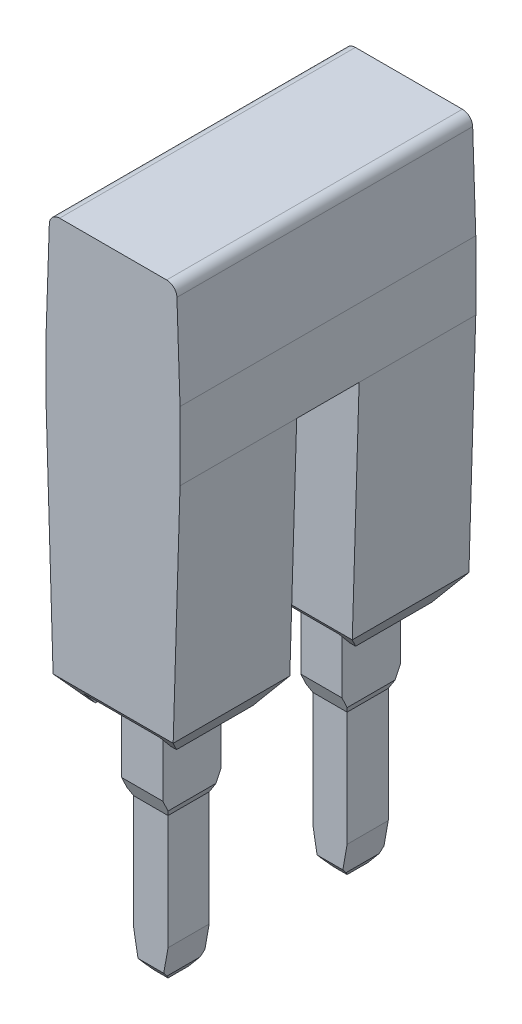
ISO-10303-21;
HEADER;
FILE_DESCRIPTION(('STEP AP214'),'2;1');
FILE_NAME('part.step','',(''),(''),'','','');
FILE_SCHEMA(('AUTOMOTIVE_DESIGN { 1 0 10303 214 1 1 1 1 }'));
ENDSEC;
DATA;
#1=APPLICATION_CONTEXT('core data for automotive mechanical design processes');
#2=APPLICATION_PROTOCOL_DEFINITION('international standard','automotive_design',2000,#1);
#3=PRODUCT_CONTEXT('',#1,'mechanical');
#4=PRODUCT('Part','Part','',(#3));
#5=PRODUCT_RELATED_PRODUCT_CATEGORY('part','',(#4));
#6=PRODUCT_DEFINITION_FORMATION('','',#4);
#7=PRODUCT_DEFINITION_CONTEXT('part definition',#1,'design');
#8=PRODUCT_DEFINITION('design','',#6,#7);
#9=PRODUCT_DEFINITION_SHAPE('','',#8);
#10=(LENGTH_UNIT() NAMED_UNIT(*) SI_UNIT(.MILLI.,.METRE.));
#11=(NAMED_UNIT(*) PLANE_ANGLE_UNIT() SI_UNIT($,.RADIAN.));
#12=(NAMED_UNIT(*) SI_UNIT($,.STERADIAN.) SOLID_ANGLE_UNIT());
#13=UNCERTAINTY_MEASURE_WITH_UNIT(LENGTH_MEASURE(1.E-05),#10,'distance_accuracy_value','');
#14=(GEOMETRIC_REPRESENTATION_CONTEXT(3) GLOBAL_UNCERTAINTY_ASSIGNED_CONTEXT((#13)) GLOBAL_UNIT_ASSIGNED_CONTEXT((#10,
#11,#12)) REPRESENTATION_CONTEXT('',''));
#15=CARTESIAN_POINT('',(0.,0.,0.));
#16=DIRECTION('',(0.,0.,1.));
#17=DIRECTION('',(1.,0.,0.));
#18=AXIS2_PLACEMENT_3D('',#15,#16,#17);
#19=CARTESIAN_POINT('',(0.6,0.,0.));
#20=DIRECTION('',(1.,0.,0.));
#21=DIRECTION('',(0.,0.,-1.));
#22=AXIS2_PLACEMENT_3D('',#19,#20,#21);
#23=PLANE('',#22);
#24=DIRECTION('',(0.,1.,0.));
#25=VECTOR('',#24,1.);
#26=CARTESIAN_POINT('',(0.6,4.9361267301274,0.85));
#27=LINE('',#26,#25);
#28=CARTESIAN_POINT('',(0.6,4.9361267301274,0.85));
#29=VERTEX_POINT('',#28);
#30=CARTESIAN_POINT('',(0.6,7.1,0.85));
#31=VERTEX_POINT('',#30);
#32=EDGE_CURVE('E9',#29,#31,#27,.T.);
#33=ORIENTED_EDGE('',*,*,#32,.T.);
#34=DIRECTION('',(0.,0.,-1.));
#35=VECTOR('',#34,1.);
#36=CARTESIAN_POINT('',(0.6,7.1,3.4));
#37=LINE('',#36,#35);
#38=CARTESIAN_POINT('',(0.6,7.1,2.55));
#39=VERTEX_POINT('',#38);
#40=EDGE_CURVE('E23',#39,#31,#37,.T.);
#41=ORIENTED_EDGE('',*,*,#40,.F.);
#42=DIRECTION('',(0.,-1.,0.));
#43=VECTOR('',#42,1.);
#44=CARTESIAN_POINT('',(0.6,10.,2.55));
#45=LINE('',#44,#43);
#46=CARTESIAN_POINT('',(0.6,4.9361267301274,2.55));
#47=VERTEX_POINT('',#46);
#48=EDGE_CURVE('E1233',#39,#47,#45,.T.);
#49=ORIENTED_EDGE('',*,*,#48,.T.);
#50=DIRECTION('',(0.,-0.906307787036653,-0.422618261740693));
#51=VECTOR('',#50,1.);
#52=CARTESIAN_POINT('',(0.6,4.9361267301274,2.55));
#53=LINE('',#52,#51);
#54=CARTESIAN_POINT('',(0.6,4.614450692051,2.4));
#55=VERTEX_POINT('',#54);
#56=EDGE_CURVE('E1229',#47,#55,#53,.T.);
#57=ORIENTED_EDGE('',*,*,#56,.T.);
#58=DIRECTION('',(0.,0.,-1.));
#59=VECTOR('',#58,1.);
#60=CARTESIAN_POINT('',(0.6,4.614450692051,8.62));
#61=LINE('',#60,#59);
#62=CARTESIAN_POINT('',(0.6,4.614450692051,0.999999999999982));
#63=VERTEX_POINT('',#62);
#64=EDGE_CURVE('E1225',#55,#63,#61,.T.);
#65=ORIENTED_EDGE('',*,*,#64,.T.);
#66=DIRECTION('',(0.,0.906307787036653,-0.422618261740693));
#67=VECTOR('',#66,1.);
#68=CARTESIAN_POINT('',(0.6,4.4,1.1));
#69=LINE('',#68,#67);
#70=EDGE_CURVE('E1221',#63,#29,#69,.T.);
#71=ORIENTED_EDGE('',*,*,#70,.T.);
#72=EDGE_LOOP('',(#33,#41,#49,#57,#65,#71));
#73=FACE_BOUND('',#72,.T.);
#74=ADVANCED_FACE('F15',(#73),#23,.T.);
#75=CARTESIAN_POINT('',(0.6,4.4,1.1));
#76=DIRECTION('',(0.,0.422618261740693,0.906307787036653));
#77=DIRECTION('',(0.,-0.906307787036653,0.422618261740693));
#78=AXIS2_PLACEMENT_3D('',#75,#76,#77);
#79=PLANE('',#78);
#80=DIRECTION('',(0.389281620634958,0.834817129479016,-0.389281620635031));
#81=VECTOR('',#80,1.);
#82=CARTESIAN_POINT('',(0.515154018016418,4.43249789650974,1.08484598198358));
#83=LINE('',#82,#81);
#84=CARTESIAN_POINT('',(0.5,4.4,1.1));
#85=VERTEX_POINT('',#84);
#86=EDGE_CURVE('E1216',#85,#63,#83,.T.);
#87=ORIENTED_EDGE('',*,*,#86,.F.);
#88=DIRECTION('',(-1.,0.,0.));
#89=VECTOR('',#88,1.);
#90=CARTESIAN_POINT('',(0.6,4.4,1.1));
#91=LINE('',#90,#89);
#92=CARTESIAN_POINT('',(-0.5,4.4,1.1));
#93=VERTEX_POINT('',#92);
#94=EDGE_CURVE('E1212',#85,#93,#91,.T.);
#95=ORIENTED_EDGE('',*,*,#94,.T.);
#96=DIRECTION('',(0.389281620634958,-0.834817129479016,0.389281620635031));
#97=VECTOR('',#96,1.);
#98=CARTESIAN_POINT('',(-0.333305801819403,4.04252313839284,1.26669419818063));
#99=LINE('',#98,#97);
#100=CARTESIAN_POINT('',(-0.6,4.614450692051,0.999999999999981));
#101=VERTEX_POINT('',#100);
#102=EDGE_CURVE('E1207',#101,#93,#99,.T.);
#103=ORIENTED_EDGE('',*,*,#102,.F.);
#104=DIRECTION('',(0.,0.906307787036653,-0.422618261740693));
#105=VECTOR('',#104,1.);
#106=CARTESIAN_POINT('',(-0.6,4.4,1.1));
#107=LINE('',#106,#105);
#108=CARTESIAN_POINT('',(-0.6,4.9361267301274,0.85));
#109=VERTEX_POINT('',#108);
#110=EDGE_CURVE('E1203',#101,#109,#107,.T.);
#111=ORIENTED_EDGE('',*,*,#110,.T.);
#112=DIRECTION('',(-1.,0.,0.));
#113=VECTOR('',#112,1.);
#114=CARTESIAN_POINT('',(0.6,4.9361267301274,0.85));
#115=LINE('',#114,#113);
#116=EDGE_CURVE('E1198',#29,#109,#115,.T.);
#117=ORIENTED_EDGE('',*,*,#116,.F.);
#118=ORIENTED_EDGE('',*,*,#70,.F.);
#119=EDGE_LOOP('',(#87,#95,#103,#111,#117,#118));
#120=FACE_BOUND('',#119,.T.);
#121=ADVANCED_FACE('F1262',(#120),#79,.F.);
#122=CARTESIAN_POINT('',(0.6,4.9361267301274,0.85));
#123=DIRECTION('',(0.,0.,1.));
#124=DIRECTION('',(1.,0.,0.));
#125=AXIS2_PLACEMENT_3D('',#122,#123,#124);
#126=PLANE('',#125);
#127=DIRECTION('',(0.,1.,0.));
#128=VECTOR('',#127,1.);
#129=CARTESIAN_POINT('',(-0.6,4.9361267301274,0.85));
#130=LINE('',#129,#128);
#131=CARTESIAN_POINT('',(-0.6,7.1,0.85));
#132=VERTEX_POINT('',#131);
#133=EDGE_CURVE('E1194',#109,#132,#130,.T.);
#134=ORIENTED_EDGE('',*,*,#133,.T.);
#135=DIRECTION('',(1.,0.,0.));
#136=VECTOR('',#135,1.);
#137=CARTESIAN_POINT('',(-1.1,7.1,0.85));
#138=LINE('',#137,#136);
#139=EDGE_CURVE('E1190',#132,#31,#138,.T.);
#140=ORIENTED_EDGE('',*,*,#139,.T.);
#141=ORIENTED_EDGE('',*,*,#32,.F.);
#142=ORIENTED_EDGE('',*,*,#116,.T.);
#143=EDGE_LOOP('',(#134,#140,#141,#142));
#144=FACE_BOUND('',#143,.T.);
#145=ADVANCED_FACE('F1266',(#144),#126,.F.);
#146=CARTESIAN_POINT('',(-1.1,7.1,3.4));
#147=DIRECTION('',(0.,1.,0.));
#148=DIRECTION('',(0.,0.,1.));
#149=AXIS2_PLACEMENT_3D('',#146,#147,#148);
#150=PLANE('',#149);
#151=DIRECTION('',(-1.,0.,0.));
#152=VECTOR('',#151,1.);
#153=CARTESIAN_POINT('',(-1.1,7.1,2.55));
#154=LINE('',#153,#152);
#155=CARTESIAN_POINT('',(-0.6,7.1,2.55));
#156=VERTEX_POINT('',#155);
#157=EDGE_CURVE('E1185',#39,#156,#154,.T.);
#158=ORIENTED_EDGE('',*,*,#157,.F.);
#159=ORIENTED_EDGE('',*,*,#40,.T.);
#160=ORIENTED_EDGE('',*,*,#139,.F.);
#161=DIRECTION('',(0.,0.,-1.));
#162=VECTOR('',#161,1.);
#163=CARTESIAN_POINT('',(-0.6,7.1,3.4));
#164=LINE('',#163,#162);
#165=EDGE_CURVE('E1180',#156,#132,#164,.T.);
#166=ORIENTED_EDGE('',*,*,#165,.F.);
#167=EDGE_LOOP('',(#158,#159,#160,#166));
#168=FACE_BOUND('',#167,.T.);
#169=DIRECTION('',(-1.,0.,0.));
#170=VECTOR('',#169,1.);
#171=CARTESIAN_POINT('',(-1.1,7.1,0.251729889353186));
#172=LINE('',#171,#170);
#173=CARTESIAN_POINT('',(1.1,7.1,0.251729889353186));
#174=VERTEX_POINT('',#173);
#175=CARTESIAN_POINT('',(-1.1,7.1,0.251729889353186));
#176=VERTEX_POINT('',#175);
#177=EDGE_CURVE('E1175',#174,#176,#172,.T.);
#178=ORIENTED_EDGE('',*,*,#177,.F.);
#179=DIRECTION('',(0.,0.,-1.));
#180=VECTOR('',#179,1.);
#181=CARTESIAN_POINT('',(1.1,7.1,3.4));
#182=LINE('',#181,#180);
#183=CARTESIAN_POINT('',(1.1,7.1,3.14827011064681));
#184=VERTEX_POINT('',#183);
#185=EDGE_CURVE('E1170',#184,#174,#182,.T.);
#186=ORIENTED_EDGE('',*,*,#185,.F.);
#187=DIRECTION('',(1.,0.,0.));
#188=VECTOR('',#187,1.);
#189=CARTESIAN_POINT('',(-1.1,7.1,3.14827011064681));
#190=LINE('',#189,#188);
#191=CARTESIAN_POINT('',(-1.1,7.1,3.14827011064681));
#192=VERTEX_POINT('',#191);
#193=EDGE_CURVE('E1165',#192,#184,#190,.T.);
#194=ORIENTED_EDGE('',*,*,#193,.F.);
#195=DIRECTION('',(0.,0.,-1.));
#196=VECTOR('',#195,1.);
#197=CARTESIAN_POINT('',(-1.1,7.1,3.4));
#198=LINE('',#197,#196);
#199=EDGE_CURVE('E1161',#192,#176,#198,.T.);
#200=ORIENTED_EDGE('',*,*,#199,.T.);
#201=EDGE_LOOP('',(#178,#186,#194,#200));
#202=FACE_BOUND('',#201,.T.);
#203=ADVANCED_FACE('F1243',(#168,#202),#150,.F.);
#204=CARTESIAN_POINT('',(-1.1,6.7,3.4));
#205=DIRECTION('',(-1.,0.,0.));
#206=DIRECTION('',(0.,0.,1.));
#207=AXIS2_PLACEMENT_3D('',#204,#205,#206);
#208=PLANE('',#207);
#209=DIRECTION('',(0.,-0.766044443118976,0.642787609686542));
#210=VECTOR('',#209,1.);
#211=CARTESIAN_POINT('',(-1.1,5.31504995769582,1.7494808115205));
#212=LINE('',#211,#210);
#213=CARTESIAN_POINT('',(-1.1,6.7,0.5873697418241));
#214=VERTEX_POINT('',#213);
#215=EDGE_CURVE('E1156',#176,#214,#212,.T.);
#216=ORIENTED_EDGE('',*,*,#215,.F.);
#217=ORIENTED_EDGE('',*,*,#199,.F.);
#218=DIRECTION('',(0.,0.766044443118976,0.642787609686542));
#219=VECTOR('',#218,1.);
#220=CARTESIAN_POINT('',(-1.1,6.98922313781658,3.05531728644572));
#221=LINE('',#220,#219);
#222=CARTESIAN_POINT('',(-1.1,6.7,2.8126302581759));
#223=VERTEX_POINT('',#222);
#224=EDGE_CURVE('E1151',#223,#192,#221,.T.);
#225=ORIENTED_EDGE('',*,*,#224,.F.);
#226=DIRECTION('',(0.,0.,-1.));
#227=VECTOR('',#226,1.);
#228=CARTESIAN_POINT('',(-1.1,6.7,3.4));
#229=LINE('',#228,#227);
#230=EDGE_CURVE('E1147',#223,#214,#229,.T.);
#231=ORIENTED_EDGE('',*,*,#230,.T.);
#232=EDGE_LOOP('',(#216,#217,#225,#231));
#233=FACE_BOUND('',#232,.T.);
#234=ADVANCED_FACE('F1319',(#233),#208,.F.);
#235=CARTESIAN_POINT('',(-1.2598547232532,6.7,3.4));
#236=DIRECTION('',(0.,1.,0.));
#237=DIRECTION('',(0.,0.,1.));
#238=AXIS2_PLACEMENT_3D('',#235,#236,#237);
#239=PLANE('',#238);
#240=DIRECTION('',(-1.,0.,0.));
#241=VECTOR('',#240,1.);
#242=CARTESIAN_POINT('',(2.,6.7,0.5873697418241));
#243=LINE('',#242,#241);
#244=CARTESIAN_POINT('',(-1.2598547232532,6.7,0.5873697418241));
#245=VERTEX_POINT('',#244);
#246=EDGE_CURVE('E1142',#214,#245,#243,.T.);
#247=ORIENTED_EDGE('',*,*,#246,.F.);
#248=ORIENTED_EDGE('',*,*,#230,.F.);
#249=DIRECTION('',(-1.,0.,0.));
#250=VECTOR('',#249,1.);
#251=CARTESIAN_POINT('',(2.,6.7,2.8126302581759));
#252=LINE('',#251,#250);
#253=CARTESIAN_POINT('',(-1.2598547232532,6.7,2.8126302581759));
#254=VERTEX_POINT('',#253);
#255=EDGE_CURVE('E1138',#223,#254,#252,.T.);
#256=ORIENTED_EDGE('',*,*,#255,.T.);
#257=DIRECTION('',(0.,0.,-1.));
#258=VECTOR('',#257,1.);
#259=CARTESIAN_POINT('',(-1.2598547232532,6.7,3.4));
#260=LINE('',#259,#258);
#261=EDGE_CURVE('E1134',#254,#245,#260,.T.);
#262=ORIENTED_EDGE('',*,*,#261,.T.);
#263=EDGE_LOOP('',(#247,#248,#256,#262));
#264=FACE_BOUND('',#263,.T.);
#265=ADVANCED_FACE('F1322',(#264),#239,.F.);
#266=CARTESIAN_POINT('',(-1.75,7.4,3.4));
#267=DIRECTION('',(0.81915204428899,0.573576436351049,0.));
#268=DIRECTION('',(-0.573576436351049,0.81915204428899,0.));
#269=AXIS2_PLACEMENT_3D('',#266,#267,#268);
#270=PLANE('',#269);
#271=DIRECTION('',(-0.472684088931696,0.67506283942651,-0.566444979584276));
#272=VECTOR('',#271,1.);
#273=CARTESIAN_POINT('',(-0.83965160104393,6.09988774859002,1.09092371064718));
#274=LINE('',#273,#272);
#275=CARTESIAN_POINT('',(-1.75,7.4,0.));
#276=VERTEX_POINT('',#275);
#277=EDGE_CURVE('E1129',#245,#276,#274,.T.);
#278=ORIENTED_EDGE('',*,*,#277,.F.);
#279=ORIENTED_EDGE('',*,*,#261,.F.);
#280=DIRECTION('',(0.472684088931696,-0.67506283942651,-0.566444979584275));
#281=VECTOR('',#280,1.);
#282=CARTESIAN_POINT('',(-1.75,7.4,3.4));
#283=LINE('',#282,#281);
#284=CARTESIAN_POINT('',(-1.75,7.4,3.4));
#285=VERTEX_POINT('',#284);
#286=EDGE_CURVE('E1124',#285,#254,#283,.T.);
#287=ORIENTED_EDGE('',*,*,#286,.F.);
#288=DIRECTION('',(0.,0.,-1.));
#289=VECTOR('',#288,1.);
#290=CARTESIAN_POINT('',(-1.75,7.4,3.4));
#291=LINE('',#290,#289);
#292=EDGE_CURVE('E1120',#285,#276,#291,.T.);
#293=ORIENTED_EDGE('',*,*,#292,.T.);
#294=EDGE_LOOP('',(#278,#279,#287,#293));
#295=FACE_BOUND('',#294,.T.);
#296=ADVANCED_FACE('F1326',(#295),#270,.F.);
#297=CARTESIAN_POINT('',(-1.95,14.,3.4));
#298=DIRECTION('',(0.999541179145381,0.0302891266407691,0.));
#299=DIRECTION('',(-0.0302891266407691,0.999541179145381,0.));
#300=AXIS2_PLACEMENT_3D('',#297,#298,#299);
#301=PLANE('',#300);
#302=DIRECTION('',(0.0302891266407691,-0.999541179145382,0.));
#303=VECTOR('',#302,1.);
#304=CARTESIAN_POINT('',(-1.95,14.,0.));
#305=LINE('',#304,#303);
#306=CARTESIAN_POINT('',(-1.95,14.,0.));
#307=VERTEX_POINT('',#306);
#308=EDGE_CURVE('E1115',#307,#276,#305,.T.);
#309=ORIENTED_EDGE('',*,*,#308,.T.);
#310=ORIENTED_EDGE('',*,*,#292,.F.);
#311=DIRECTION('',(0.0302891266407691,-0.999541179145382,0.));
#312=VECTOR('',#311,1.);
#313=CARTESIAN_POINT('',(-1.95,14.,3.4));
#314=LINE('',#313,#312);
#315=CARTESIAN_POINT('',(-1.95,14.,3.4));
#316=VERTEX_POINT('',#315);
#317=EDGE_CURVE('E1110',#316,#285,#314,.T.);
#318=ORIENTED_EDGE('',*,*,#317,.F.);
#319=DIRECTION('',(0.,0.,-1.));
#320=VECTOR('',#319,1.);
#321=CARTESIAN_POINT('',(-1.95,14.,3.4));
#322=LINE('',#321,#320);
#323=EDGE_CURVE('E1106',#316,#307,#322,.T.);
#324=ORIENTED_EDGE('',*,*,#323,.T.);
#325=EDGE_LOOP('',(#309,#310,#318,#324));
#326=FACE_BOUND('',#325,.T.);
#327=ADVANCED_FACE('F1330',(#326),#301,.F.);
#328=CARTESIAN_POINT('',(-1.95,16.,8.62));
#329=DIRECTION('',(1.,0.,0.));
#330=DIRECTION('',(0.,0.,-1.));
#331=AXIS2_PLACEMENT_3D('',#328,#329,#330);
#332=PLANE('',#331);
#333=DIRECTION('',(0.,-1.,0.));
#334=VECTOR('',#333,1.);
#335=CARTESIAN_POINT('',(-1.95,16.,0.));
#336=LINE('',#335,#334);
#337=CARTESIAN_POINT('',(-1.95,16.,0.));
#338=VERTEX_POINT('',#337);
#339=EDGE_CURVE('E1101',#338,#307,#336,.T.);
#340=ORIENTED_EDGE('',*,*,#339,.T.);
#341=ORIENTED_EDGE('',*,*,#323,.F.);
#342=DIRECTION('',(0.,0.,-1.));
#343=VECTOR('',#342,1.);
#344=CARTESIAN_POINT('',(-1.95,14.,8.62));
#345=LINE('',#344,#343);
#346=CARTESIAN_POINT('',(-1.95,14.,5.22));
#347=VERTEX_POINT('',#346);
#348=EDGE_CURVE('E1096',#347,#316,#345,.T.);
#349=ORIENTED_EDGE('',*,*,#348,.F.);
#350=DIRECTION('',(0.,0.,-1.));
#351=VECTOR('',#350,1.);
#352=CARTESIAN_POINT('',(-1.95,14.,8.62));
#353=LINE('',#352,#351);
#354=CARTESIAN_POINT('',(-1.95,14.,8.62));
#355=VERTEX_POINT('',#354);
#356=EDGE_CURVE('E1091',#355,#347,#353,.T.);
#357=ORIENTED_EDGE('',*,*,#356,.F.);
#358=DIRECTION('',(0.,-1.,0.));
#359=VECTOR('',#358,1.);
#360=CARTESIAN_POINT('',(-1.95,16.,8.62));
#361=LINE('',#360,#359);
#362=CARTESIAN_POINT('',(-1.95,16.,8.62));
#363=VERTEX_POINT('',#362);
#364=EDGE_CURVE('E1086',#363,#355,#361,.T.);
#365=ORIENTED_EDGE('',*,*,#364,.F.);
#366=DIRECTION('',(0.,0.,-1.));
#367=VECTOR('',#366,1.);
#368=CARTESIAN_POINT('',(-1.95,16.,8.62));
#369=LINE('',#368,#367);
#370=EDGE_CURVE('E1082',#363,#338,#369,.T.);
#371=ORIENTED_EDGE('',*,*,#370,.T.);
#372=EDGE_LOOP('',(#340,#341,#349,#357,#365,#371));
#373=FACE_BOUND('',#372,.T.);
#374=ADVANCED_FACE('F1334',(#373),#332,.F.);
#375=CARTESIAN_POINT('',(-1.8596668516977,18.70999444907,8.62));
#376=DIRECTION('',(0.999444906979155,-0.0333148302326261,0.));
#377=DIRECTION('',(0.0333148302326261,0.999444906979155,0.));
#378=AXIS2_PLACEMENT_3D('',#375,#376,#377);
#379=PLANE('',#378);
#380=DIRECTION('',(-0.0333148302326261,-0.999444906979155,0.));
#381=VECTOR('',#380,1.);
#382=CARTESIAN_POINT('',(-1.8596668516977,18.70999444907,0.));
#383=LINE('',#382,#381);
#384=CARTESIAN_POINT('',(-1.8596668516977,18.70999444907,0.));
#385=VERTEX_POINT('',#384);
#386=EDGE_CURVE('E1077',#385,#338,#383,.T.);
#387=ORIENTED_EDGE('',*,*,#386,.T.);
#388=ORIENTED_EDGE('',*,*,#370,.F.);
#389=DIRECTION('',(-0.0333148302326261,-0.999444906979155,0.));
#390=VECTOR('',#389,1.);
#391=CARTESIAN_POINT('',(-1.8596668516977,18.70999444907,8.62));
#392=LINE('',#391,#390);
#393=CARTESIAN_POINT('',(-1.8596668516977,18.70999444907,8.62));
#394=VERTEX_POINT('',#393);
#395=EDGE_CURVE('E1072',#394,#363,#392,.T.);
#396=ORIENTED_EDGE('',*,*,#395,.F.);
#397=DIRECTION('',(0.,0.,-1.));
#398=VECTOR('',#397,1.);
#399=CARTESIAN_POINT('',(-1.8596668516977,18.70999444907,8.62));
#400=LINE('',#399,#398);
#401=EDGE_CURVE('E1068',#394,#385,#400,.T.);
#402=ORIENTED_EDGE('',*,*,#401,.T.);
#403=EDGE_LOOP('',(#387,#388,#396,#402));
#404=FACE_BOUND('',#403,.T.);
#405=ADVANCED_FACE('F1338',(#404),#379,.F.);
#406=CARTESIAN_POINT('',(-1.55983337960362,18.6999999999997,8.62));
#407=DIRECTION('',(0.,0.,-1.));
#408=DIRECTION('',(0.695228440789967,-0.718788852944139,0.));
#409=AXIS2_PLACEMENT_3D('',#406,#407,#408);
#410=CYLINDRICAL_SURFACE('',#409,0.300000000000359);
#411=CARTESIAN_POINT('',(-1.55983337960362,18.6999999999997,0.));
#412=DIRECTION('',(0.,0.,1.));
#413=DIRECTION('',(1.,0.,0.));
#414=AXIS2_PLACEMENT_3D('',#411,#412,#413);
#415=CIRCLE('',#414,0.300000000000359);
#416=CARTESIAN_POINT('',(-1.5598333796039,19.,0.));
#417=VERTEX_POINT('',#416);
#418=EDGE_CURVE('E1063',#417,#385,#415,.T.);
#419=ORIENTED_EDGE('',*,*,#418,.T.);
#420=ORIENTED_EDGE('',*,*,#401,.F.);
#421=CARTESIAN_POINT('',(-1.55983337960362,18.6999999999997,8.62));
#422=DIRECTION('',(0.,0.,1.));
#423=DIRECTION('',(1.,0.,0.));
#424=AXIS2_PLACEMENT_3D('',#421,#422,#423);
#425=CIRCLE('',#424,0.300000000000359);
#426=CARTESIAN_POINT('',(-1.5598333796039,19.,8.62));
#427=VERTEX_POINT('',#426);
#428=EDGE_CURVE('E1058',#427,#394,#425,.T.);
#429=ORIENTED_EDGE('',*,*,#428,.F.);
#430=DIRECTION('',(0.,0.,-1.));
#431=VECTOR('',#430,1.);
#432=CARTESIAN_POINT('',(-1.5598333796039,19.,8.62));
#433=LINE('',#432,#431);
#434=EDGE_CURVE('E1054',#427,#417,#433,.T.);
#435=ORIENTED_EDGE('',*,*,#434,.T.);
#436=EDGE_LOOP('',(#419,#420,#429,#435));
#437=FACE_BOUND('',#436,.T.);
#438=ADVANCED_FACE('F1342',(#437),#410,.T.);
#439=CARTESIAN_POINT('',(1.5598333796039,19.,8.62));
#440=DIRECTION('',(0.,-1.,0.));
#441=DIRECTION('',(0.,0.,-1.));
#442=AXIS2_PLACEMENT_3D('',#439,#440,#441);
#443=PLANE('',#442);
#444=DIRECTION('',(-1.,0.,0.));
#445=VECTOR('',#444,1.);
#446=CARTESIAN_POINT('',(1.5598333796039,19.,0.));
#447=LINE('',#446,#445);
#448=CARTESIAN_POINT('',(1.5598333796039,19.,0.));
#449=VERTEX_POINT('',#448);
#450=EDGE_CURVE('E1049',#449,#417,#447,.T.);
#451=ORIENTED_EDGE('',*,*,#450,.T.);
#452=ORIENTED_EDGE('',*,*,#434,.F.);
#453=DIRECTION('',(-1.,0.,0.));
#454=VECTOR('',#453,1.);
#455=CARTESIAN_POINT('',(1.5598333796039,19.,8.62));
#456=LINE('',#455,#454);
#457=CARTESIAN_POINT('',(1.5598333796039,19.,8.62));
#458=VERTEX_POINT('',#457);
#459=EDGE_CURVE('E1044',#458,#427,#456,.T.);
#460=ORIENTED_EDGE('',*,*,#459,.F.);
#461=DIRECTION('',(0.,0.,-1.));
#462=VECTOR('',#461,1.);
#463=CARTESIAN_POINT('',(1.5598333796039,19.,8.62));
#464=LINE('',#463,#462);
#465=EDGE_CURVE('E1040',#458,#449,#464,.T.);
#466=ORIENTED_EDGE('',*,*,#465,.T.);
#467=EDGE_LOOP('',(#451,#452,#460,#466));
#468=FACE_BOUND('',#467,.T.);
#469=ADVANCED_FACE('F1346',(#468),#443,.F.);
#470=CARTESIAN_POINT('',(1.55983337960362,18.6999999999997,8.62));
#471=DIRECTION('',(0.,0.,-1.));
#472=DIRECTION('',(-0.695228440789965,-0.718788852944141,0.));
#473=AXIS2_PLACEMENT_3D('',#470,#471,#472);
#474=CYLINDRICAL_SURFACE('',#473,0.300000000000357);
#475=CARTESIAN_POINT('',(1.55983337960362,18.6999999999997,0.));
#476=DIRECTION('',(0.,0.,1.));
#477=DIRECTION('',(1.,0.,0.));
#478=AXIS2_PLACEMENT_3D('',#475,#476,#477);
#479=CIRCLE('',#478,0.300000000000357);
#480=CARTESIAN_POINT('',(1.8596668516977,18.70999444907,0.));
#481=VERTEX_POINT('',#480);
#482=EDGE_CURVE('E1035',#481,#449,#479,.T.);
#483=ORIENTED_EDGE('',*,*,#482,.T.);
#484=ORIENTED_EDGE('',*,*,#465,.F.);
#485=CARTESIAN_POINT('',(1.55983337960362,18.6999999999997,8.62));
#486=DIRECTION('',(0.,0.,1.));
#487=DIRECTION('',(1.,0.,0.));
#488=AXIS2_PLACEMENT_3D('',#485,#486,#487);
#489=CIRCLE('',#488,0.300000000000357);
#490=CARTESIAN_POINT('',(1.8596668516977,18.70999444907,8.62));
#491=VERTEX_POINT('',#490);
#492=EDGE_CURVE('E1030',#491,#458,#489,.T.);
#493=ORIENTED_EDGE('',*,*,#492,.F.);
#494=DIRECTION('',(0.,0.,-1.));
#495=VECTOR('',#494,1.);
#496=CARTESIAN_POINT('',(1.8596668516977,18.70999444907,8.62));
#497=LINE('',#496,#495);
#498=EDGE_CURVE('E1026',#491,#481,#497,.T.);
#499=ORIENTED_EDGE('',*,*,#498,.T.);
#500=EDGE_LOOP('',(#483,#484,#493,#499));
#501=FACE_BOUND('',#500,.T.);
#502=ADVANCED_FACE('F1350',(#501),#474,.T.);
#503=CARTESIAN_POINT('',(1.95,16.,8.62));
#504=DIRECTION('',(-0.999444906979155,-0.0333148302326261,0.));
#505=DIRECTION('',(0.0333148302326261,-0.999444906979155,0.));
#506=AXIS2_PLACEMENT_3D('',#503,#504,#505);
#507=PLANE('',#506);
#508=DIRECTION('',(-0.0333148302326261,0.999444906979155,0.));
#509=VECTOR('',#508,1.);
#510=CARTESIAN_POINT('',(1.95,16.,0.));
#511=LINE('',#510,#509);
#512=CARTESIAN_POINT('',(1.95,16.,0.));
#513=VERTEX_POINT('',#512);
#514=EDGE_CURVE('E1021',#513,#481,#511,.T.);
#515=ORIENTED_EDGE('',*,*,#514,.T.);
#516=ORIENTED_EDGE('',*,*,#498,.F.);
#517=DIRECTION('',(-0.0333148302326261,0.999444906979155,0.));
#518=VECTOR('',#517,1.);
#519=CARTESIAN_POINT('',(1.95,16.,8.62));
#520=LINE('',#519,#518);
#521=CARTESIAN_POINT('',(1.95,16.,8.62));
#522=VERTEX_POINT('',#521);
#523=EDGE_CURVE('E1016',#522,#491,#520,.T.);
#524=ORIENTED_EDGE('',*,*,#523,.F.);
#525=DIRECTION('',(0.,0.,-1.));
#526=VECTOR('',#525,1.);
#527=CARTESIAN_POINT('',(1.95,16.,8.62));
#528=LINE('',#527,#526);
#529=EDGE_CURVE('E1012',#522,#513,#528,.T.);
#530=ORIENTED_EDGE('',*,*,#529,.T.);
#531=EDGE_LOOP('',(#515,#516,#524,#530));
#532=FACE_BOUND('',#531,.T.);
#533=ADVANCED_FACE('F1354',(#532),#507,.F.);
#534=CARTESIAN_POINT('',(1.95,14.,8.62));
#535=DIRECTION('',(-1.,0.,0.));
#536=DIRECTION('',(0.,0.,1.));
#537=AXIS2_PLACEMENT_3D('',#534,#535,#536);
#538=PLANE('',#537);
#539=DIRECTION('',(0.,1.,0.));
#540=VECTOR('',#539,1.);
#541=CARTESIAN_POINT('',(1.95,14.,0.));
#542=LINE('',#541,#540);
#543=CARTESIAN_POINT('',(1.95,14.,0.));
#544=VERTEX_POINT('',#543);
#545=EDGE_CURVE('E1007',#544,#513,#542,.T.);
#546=ORIENTED_EDGE('',*,*,#545,.T.);
#547=ORIENTED_EDGE('',*,*,#529,.F.);
#548=DIRECTION('',(0.,1.,0.));
#549=VECTOR('',#548,1.);
#550=CARTESIAN_POINT('',(1.95,14.,8.62));
#551=LINE('',#550,#549);
#552=CARTESIAN_POINT('',(1.95,14.,8.62));
#553=VERTEX_POINT('',#552);
#554=EDGE_CURVE('E1002',#553,#522,#551,.T.);
#555=ORIENTED_EDGE('',*,*,#554,.F.);
#556=DIRECTION('',(0.,0.,-1.));
#557=VECTOR('',#556,1.);
#558=CARTESIAN_POINT('',(1.95,14.,8.62));
#559=LINE('',#558,#557);
#560=CARTESIAN_POINT('',(1.95,14.,5.22));
#561=VERTEX_POINT('',#560);
#562=EDGE_CURVE('E998',#553,#561,#559,.T.);
#563=ORIENTED_EDGE('',*,*,#562,.T.);
#564=DIRECTION('',(0.,0.,-1.));
#565=VECTOR('',#564,1.);
#566=CARTESIAN_POINT('',(1.95,14.,8.62));
#567=LINE('',#566,#565);
#568=CARTESIAN_POINT('',(1.95,14.,3.4));
#569=VERTEX_POINT('',#568);
#570=EDGE_CURVE('E994',#561,#569,#567,.T.);
#571=ORIENTED_EDGE('',*,*,#570,.T.);
#572=DIRECTION('',(0.,0.,-1.));
#573=VECTOR('',#572,1.);
#574=CARTESIAN_POINT('',(1.95,14.,3.4));
#575=LINE('',#574,#573);
#576=EDGE_CURVE('E990',#569,#544,#575,.T.);
#577=ORIENTED_EDGE('',*,*,#576,.T.);
#578=EDGE_LOOP('',(#546,#547,#555,#563,#571,#577));
#579=FACE_BOUND('',#578,.T.);
#580=ADVANCED_FACE('F1358',(#579),#538,.F.);
#581=CARTESIAN_POINT('',(1.75,7.4,3.4));
#582=DIRECTION('',(-0.999541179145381,0.0302891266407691,0.));
#583=DIRECTION('',(-0.0302891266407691,-0.999541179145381,0.));
#584=AXIS2_PLACEMENT_3D('',#581,#582,#583);
#585=PLANE('',#584);
#586=DIRECTION('',(0.0302891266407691,0.999541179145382,0.));
#587=VECTOR('',#586,1.);
#588=CARTESIAN_POINT('',(1.75,7.4,0.));
#589=LINE('',#588,#587);
#590=CARTESIAN_POINT('',(1.75,7.4,0.));
#591=VERTEX_POINT('',#590);
#592=EDGE_CURVE('E985',#591,#544,#589,.T.);
#593=ORIENTED_EDGE('',*,*,#592,.T.);
#594=ORIENTED_EDGE('',*,*,#576,.F.);
#595=DIRECTION('',(0.0302891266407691,0.999541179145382,0.));
#596=VECTOR('',#595,1.);
#597=CARTESIAN_POINT('',(1.75,7.4,3.4));
#598=LINE('',#597,#596);
#599=CARTESIAN_POINT('',(1.75,7.4,3.4));
#600=VERTEX_POINT('',#599);
#601=EDGE_CURVE('E980',#600,#569,#598,.T.);
#602=ORIENTED_EDGE('',*,*,#601,.F.);
#603=DIRECTION('',(0.,0.,-1.));
#604=VECTOR('',#603,1.);
#605=CARTESIAN_POINT('',(1.75,7.4,3.4));
#606=LINE('',#605,#604);
#607=EDGE_CURVE('E976',#600,#591,#606,.T.);
#608=ORIENTED_EDGE('',*,*,#607,.T.);
#609=EDGE_LOOP('',(#593,#594,#602,#608));
#610=FACE_BOUND('',#609,.T.);
#611=ADVANCED_FACE('F1362',(#610),#585,.F.);
#612=CARTESIAN_POINT('',(1.2598547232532,6.7,3.4));
#613=DIRECTION('',(-0.81915204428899,0.573576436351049,0.));
#614=DIRECTION('',(-0.573576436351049,-0.81915204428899,0.));
#615=AXIS2_PLACEMENT_3D('',#612,#613,#614);
#616=PLANE('',#615);
#617=DIRECTION('',(-0.472684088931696,-0.67506283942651,0.566444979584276));
#618=VECTOR('',#617,1.);
#619=CARTESIAN_POINT('',(0.506774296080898,5.62448968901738,1.48983004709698));
#620=LINE('',#619,#618);
#621=CARTESIAN_POINT('',(1.2598547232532,6.7,0.5873697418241));
#622=VERTEX_POINT('',#621);
#623=EDGE_CURVE('E971',#591,#622,#620,.T.);
#624=ORIENTED_EDGE('',*,*,#623,.F.);
#625=ORIENTED_EDGE('',*,*,#607,.F.);
#626=DIRECTION('',(0.472684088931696,0.67506283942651,0.566444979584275));
#627=VECTOR('',#626,1.);
#628=CARTESIAN_POINT('',(1.41712269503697,6.92460194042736,3.0010936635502));
#629=LINE('',#628,#627);
#630=CARTESIAN_POINT('',(1.2598547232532,6.7,2.8126302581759));
#631=VERTEX_POINT('',#630);
#632=EDGE_CURVE('E966',#631,#600,#629,.T.);
#633=ORIENTED_EDGE('',*,*,#632,.F.);
#634=DIRECTION('',(0.,0.,-1.));
#635=VECTOR('',#634,1.);
#636=CARTESIAN_POINT('',(1.2598547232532,6.7,3.4));
#637=LINE('',#636,#635);
#638=EDGE_CURVE('E962',#631,#622,#637,.T.);
#639=ORIENTED_EDGE('',*,*,#638,.T.);
#640=EDGE_LOOP('',(#624,#625,#633,#639));
#641=FACE_BOUND('',#640,.T.);
#642=ADVANCED_FACE('F1366',(#641),#616,.F.);
#643=CARTESIAN_POINT('',(1.1,6.7,3.4));
#644=DIRECTION('',(0.,1.,0.));
#645=DIRECTION('',(0.,0.,1.));
#646=AXIS2_PLACEMENT_3D('',#643,#644,#645);
#647=PLANE('',#646);
#648=DIRECTION('',(-1.,0.,0.));
#649=VECTOR('',#648,1.);
#650=CARTESIAN_POINT('',(2.,6.7,0.5873697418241));
#651=LINE('',#650,#649);
#652=CARTESIAN_POINT('',(1.1,6.7,0.5873697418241));
#653=VERTEX_POINT('',#652);
#654=EDGE_CURVE('E957',#622,#653,#651,.T.);
#655=ORIENTED_EDGE('',*,*,#654,.F.);
#656=ORIENTED_EDGE('',*,*,#638,.F.);
#657=DIRECTION('',(-1.,0.,0.));
#658=VECTOR('',#657,1.);
#659=CARTESIAN_POINT('',(2.,6.7,2.8126302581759));
#660=LINE('',#659,#658);
#661=CARTESIAN_POINT('',(1.1,6.7,2.8126302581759));
#662=VERTEX_POINT('',#661);
#663=EDGE_CURVE('E953',#631,#662,#660,.T.);
#664=ORIENTED_EDGE('',*,*,#663,.T.);
#665=DIRECTION('',(0.,0.,-1.));
#666=VECTOR('',#665,1.);
#667=CARTESIAN_POINT('',(1.1,6.7,3.4));
#668=LINE('',#667,#666);
#669=EDGE_CURVE('E949',#662,#653,#668,.T.);
#670=ORIENTED_EDGE('',*,*,#669,.T.);
#671=EDGE_LOOP('',(#655,#656,#664,#670));
#672=FACE_BOUND('',#671,.T.);
#673=ADVANCED_FACE('F1370',(#672),#647,.F.);
#674=CARTESIAN_POINT('',(1.1,7.1,3.4));
#675=DIRECTION('',(1.,0.,0.));
#676=DIRECTION('',(0.,0.,-1.));
#677=AXIS2_PLACEMENT_3D('',#674,#675,#676);
#678=PLANE('',#677);
#679=DIRECTION('',(0.,0.766044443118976,-0.642787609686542));
#680=VECTOR('',#679,1.);
#681=CARTESIAN_POINT('',(1.1,5.54977959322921,1.55251926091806));
#682=LINE('',#681,#680);
#683=EDGE_CURVE('E944',#653,#174,#682,.T.);
#684=ORIENTED_EDGE('',*,*,#683,.F.);
#685=ORIENTED_EDGE('',*,*,#669,.F.);
#686=DIRECTION('',(0.,-0.766044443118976,-0.642787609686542));
#687=VECTOR('',#686,1.);
#688=CARTESIAN_POINT('',(1.1,7.22395277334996,3.25227883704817));
#689=LINE('',#688,#687);
#690=EDGE_CURVE('E939',#184,#662,#689,.T.);
#691=ORIENTED_EDGE('',*,*,#690,.F.);
#692=ORIENTED_EDGE('',*,*,#185,.T.);
#693=EDGE_LOOP('',(#684,#685,#691,#692));
#694=FACE_BOUND('',#693,.T.);
#695=ADVANCED_FACE('F1374',(#694),#678,.F.);
#696=CARTESIAN_POINT('',(2.,6.7,2.8126302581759));
#697=DIRECTION('',(0.,-0.642787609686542,0.766044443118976));
#698=DIRECTION('',(0.,-0.766044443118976,-0.642787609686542));
#699=AXIS2_PLACEMENT_3D('',#696,#697,#698);
#700=PLANE('',#699);
#701=ORIENTED_EDGE('',*,*,#286,.T.);
#702=ORIENTED_EDGE('',*,*,#255,.F.);
#703=ORIENTED_EDGE('',*,*,#224,.T.);
#704=ORIENTED_EDGE('',*,*,#193,.T.);
#705=ORIENTED_EDGE('',*,*,#690,.T.);
#706=ORIENTED_EDGE('',*,*,#663,.F.);
#707=ORIENTED_EDGE('',*,*,#632,.T.);
#708=DIRECTION('',(-1.,0.,0.));
#709=VECTOR('',#708,1.);
#710=CARTESIAN_POINT('',(0.,7.4,3.4));
#711=LINE('',#710,#709);
#712=EDGE_CURVE('E934',#600,#285,#711,.T.);
#713=ORIENTED_EDGE('',*,*,#712,.T.);
#714=EDGE_LOOP('',(#701,#702,#703,#704,#705,#706,#707,#713));
#715=FACE_BOUND('',#714,.T.);
#716=ADVANCED_FACE('F1378',(#715),#700,.T.);
#717=CARTESIAN_POINT('',(0.,0.,3.4));
#718=DIRECTION('',(0.,0.,-1.));
#719=DIRECTION('',(-1.,0.,0.));
#720=AXIS2_PLACEMENT_3D('',#717,#718,#719);
#721=PLANE('',#720);
#722=ORIENTED_EDGE('',*,*,#712,.F.);
#723=ORIENTED_EDGE('',*,*,#601,.T.);
#724=DIRECTION('',(-1.,0.,0.));
#725=VECTOR('',#724,1.);
#726=CARTESIAN_POINT('',(1.95,14.,3.4));
#727=LINE('',#726,#725);
#728=EDGE_CURVE('E929',#569,#316,#727,.T.);
#729=ORIENTED_EDGE('',*,*,#728,.T.);
#730=ORIENTED_EDGE('',*,*,#317,.T.);
#731=EDGE_LOOP('',(#722,#723,#729,#730));
#732=FACE_BOUND('',#731,.T.);
#733=ADVANCED_FACE('F1382',(#732),#721,.F.);
#734=CARTESIAN_POINT('',(-1.95,14.,8.62));
#735=DIRECTION('',(0.,1.,0.));
#736=DIRECTION('',(0.,0.,1.));
#737=AXIS2_PLACEMENT_3D('',#734,#735,#736);
#738=PLANE('',#737);
#739=ORIENTED_EDGE('',*,*,#570,.F.);
#740=DIRECTION('',(-1.,0.,0.));
#741=VECTOR('',#740,1.);
#742=CARTESIAN_POINT('',(1.95,14.,5.22));
#743=LINE('',#742,#741);
#744=EDGE_CURVE('E924',#561,#347,#743,.T.);
#745=ORIENTED_EDGE('',*,*,#744,.T.);
#746=ORIENTED_EDGE('',*,*,#348,.T.);
#747=ORIENTED_EDGE('',*,*,#728,.F.);
#748=EDGE_LOOP('',(#739,#745,#746,#747));
#749=FACE_BOUND('',#748,.T.);
#750=ADVANCED_FACE('F1386',(#749),#738,.F.);
#751=CARTESIAN_POINT('',(0.,0.,5.22));
#752=DIRECTION('',(0.,0.,-1.));
#753=DIRECTION('',(-1.,0.,0.));
#754=AXIS2_PLACEMENT_3D('',#751,#752,#753);
#755=PLANE('',#754);
#756=DIRECTION('',(0.0302891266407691,0.999541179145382,0.));
#757=VECTOR('',#756,1.);
#758=CARTESIAN_POINT('',(1.75,7.4,5.22));
#759=LINE('',#758,#757);
#760=CARTESIAN_POINT('',(1.75,7.4,5.22));
#761=VERTEX_POINT('',#760);
#762=EDGE_CURVE('E919',#761,#561,#759,.T.);
#763=ORIENTED_EDGE('',*,*,#762,.F.);
#764=DIRECTION('',(-1.,0.,0.));
#765=VECTOR('',#764,1.);
#766=CARTESIAN_POINT('',(0.,7.4,5.22));
#767=LINE('',#766,#765);
#768=CARTESIAN_POINT('',(-1.75,7.4,5.22));
#769=VERTEX_POINT('',#768);
#770=EDGE_CURVE('E915',#761,#769,#767,.T.);
#771=ORIENTED_EDGE('',*,*,#770,.T.);
#772=DIRECTION('',(0.0302891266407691,-0.999541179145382,0.));
#773=VECTOR('',#772,1.);
#774=CARTESIAN_POINT('',(-1.95,14.,5.22));
#775=LINE('',#774,#773);
#776=EDGE_CURVE('E910',#347,#769,#775,.T.);
#777=ORIENTED_EDGE('',*,*,#776,.F.);
#778=ORIENTED_EDGE('',*,*,#744,.F.);
#779=EDGE_LOOP('',(#763,#771,#777,#778));
#780=FACE_BOUND('',#779,.T.);
#781=ADVANCED_FACE('F1390',(#780),#755,.T.);
#782=CARTESIAN_POINT('',(-1.95,14.,8.62));
#783=DIRECTION('',(0.999541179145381,0.0302891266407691,0.));
#784=DIRECTION('',(-0.0302891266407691,0.999541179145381,0.));
#785=AXIS2_PLACEMENT_3D('',#782,#783,#784);
#786=PLANE('',#785);
#787=ORIENTED_EDGE('',*,*,#776,.T.);
#788=DIRECTION('',(0.,0.,-1.));
#789=VECTOR('',#788,1.);
#790=CARTESIAN_POINT('',(-1.75,7.4,8.62));
#791=LINE('',#790,#789);
#792=CARTESIAN_POINT('',(-1.75,7.4,8.62));
#793=VERTEX_POINT('',#792);
#794=EDGE_CURVE('E905',#793,#769,#791,.T.);
#795=ORIENTED_EDGE('',*,*,#794,.F.);
#796=DIRECTION('',(0.0302891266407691,-0.999541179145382,0.));
#797=VECTOR('',#796,1.);
#798=CARTESIAN_POINT('',(-1.95,14.,8.62));
#799=LINE('',#798,#797);
#800=EDGE_CURVE('E900',#355,#793,#799,.T.);
#801=ORIENTED_EDGE('',*,*,#800,.F.);
#802=ORIENTED_EDGE('',*,*,#356,.T.);
#803=EDGE_LOOP('',(#787,#795,#801,#802));
#804=FACE_BOUND('',#803,.T.);
#805=ADVANCED_FACE('F1394',(#804),#786,.F.);
#806=CARTESIAN_POINT('',(1.55983337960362,18.6999999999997,8.62));
#807=DIRECTION('',(0.,0.,1.));
#808=DIRECTION('',(1.,0.,0.));
#809=AXIS2_PLACEMENT_3D('',#806,#807,#808);
#810=PLANE('',#809);
#811=ORIENTED_EDGE('',*,*,#800,.T.);
#812=DIRECTION('',(-1.,0.,0.));
#813=VECTOR('',#812,1.);
#814=CARTESIAN_POINT('',(2.,7.4,8.62));
#815=LINE('',#814,#813);
#816=CARTESIAN_POINT('',(1.75,7.4,8.62));
#817=VERTEX_POINT('',#816);
#818=EDGE_CURVE('E895',#817,#793,#815,.T.);
#819=ORIENTED_EDGE('',*,*,#818,.F.);
#820=DIRECTION('',(0.0302891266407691,0.999541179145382,0.));
#821=VECTOR('',#820,1.);
#822=CARTESIAN_POINT('',(1.75,7.4,8.62));
#823=LINE('',#822,#821);
#824=EDGE_CURVE('E890',#817,#553,#823,.T.);
#825=ORIENTED_EDGE('',*,*,#824,.T.);
#826=ORIENTED_EDGE('',*,*,#554,.T.);
#827=ORIENTED_EDGE('',*,*,#523,.T.);
#828=ORIENTED_EDGE('',*,*,#492,.T.);
#829=ORIENTED_EDGE('',*,*,#459,.T.);
#830=ORIENTED_EDGE('',*,*,#428,.T.);
#831=ORIENTED_EDGE('',*,*,#395,.T.);
#832=ORIENTED_EDGE('',*,*,#364,.T.);
#833=EDGE_LOOP('',(#811,#819,#825,#826,#827,#828,#829,#830,#831,#832));
#834=FACE_BOUND('',#833,.T.);
#835=ADVANCED_FACE('F1398',(#834),#810,.T.);
#836=CARTESIAN_POINT('',(1.75,7.4,8.62));
#837=DIRECTION('',(-0.999541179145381,0.0302891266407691,0.));
#838=DIRECTION('',(-0.0302891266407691,-0.999541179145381,0.));
#839=AXIS2_PLACEMENT_3D('',#836,#837,#838);
#840=PLANE('',#839);
#841=ORIENTED_EDGE('',*,*,#762,.T.);
#842=ORIENTED_EDGE('',*,*,#562,.F.);
#843=ORIENTED_EDGE('',*,*,#824,.F.);
#844=DIRECTION('',(0.,0.,-1.));
#845=VECTOR('',#844,1.);
#846=CARTESIAN_POINT('',(1.75,7.4,8.62));
#847=LINE('',#846,#845);
#848=EDGE_CURVE('E885',#817,#761,#847,.T.);
#849=ORIENTED_EDGE('',*,*,#848,.T.);
#850=EDGE_LOOP('',(#841,#842,#843,#849));
#851=FACE_BOUND('',#850,.T.);
#852=ADVANCED_FACE('F1402',(#851),#840,.F.);
#853=CARTESIAN_POINT('',(1.2598547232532,6.7,8.62));
#854=DIRECTION('',(-0.81915204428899,0.573576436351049,0.));
#855=DIRECTION('',(-0.573576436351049,-0.81915204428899,0.));
#856=AXIS2_PLACEMENT_3D('',#853,#854,#855);
#857=PLANE('',#856);
#858=DIRECTION('',(-0.472684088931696,-0.67506283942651,0.566444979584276));
#859=VECTOR('',#858,1.);
#860=CARTESIAN_POINT('',(0.506774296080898,5.62448968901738,6.70983004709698));
#861=LINE('',#860,#859);
#862=CARTESIAN_POINT('',(1.2598547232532,6.7,5.8073697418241));
#863=VERTEX_POINT('',#862);
#864=EDGE_CURVE('E880',#761,#863,#861,.T.);
#865=ORIENTED_EDGE('',*,*,#864,.F.);
#866=ORIENTED_EDGE('',*,*,#848,.F.);
#867=DIRECTION('',(0.472684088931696,0.67506283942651,0.566444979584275));
#868=VECTOR('',#867,1.);
#869=CARTESIAN_POINT('',(1.41712269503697,6.92460194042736,8.2210936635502));
#870=LINE('',#869,#868);
#871=CARTESIAN_POINT('',(1.2598547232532,6.7,8.0326302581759));
#872=VERTEX_POINT('',#871);
#873=EDGE_CURVE('E875',#872,#817,#870,.T.);
#874=ORIENTED_EDGE('',*,*,#873,.F.);
#875=DIRECTION('',(0.,0.,-1.));
#876=VECTOR('',#875,1.);
#877=CARTESIAN_POINT('',(1.2598547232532,6.7,8.62));
#878=LINE('',#877,#876);
#879=EDGE_CURVE('E871',#872,#863,#878,.T.);
#880=ORIENTED_EDGE('',*,*,#879,.T.);
#881=EDGE_LOOP('',(#865,#866,#874,#880));
#882=FACE_BOUND('',#881,.T.);
#883=ADVANCED_FACE('F1406',(#882),#857,.F.);
#884=CARTESIAN_POINT('',(1.1,6.7,8.62));
#885=DIRECTION('',(0.,1.,0.));
#886=DIRECTION('',(0.,0.,1.));
#887=AXIS2_PLACEMENT_3D('',#884,#885,#886);
#888=PLANE('',#887);
#889=DIRECTION('',(-1.,0.,0.));
#890=VECTOR('',#889,1.);
#891=CARTESIAN_POINT('',(2.,6.7,5.8073697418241));
#892=LINE('',#891,#890);
#893=CARTESIAN_POINT('',(1.1,6.7,5.8073697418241));
#894=VERTEX_POINT('',#893);
#895=EDGE_CURVE('E866',#863,#894,#892,.T.);
#896=ORIENTED_EDGE('',*,*,#895,.F.);
#897=ORIENTED_EDGE('',*,*,#879,.F.);
#898=DIRECTION('',(-1.,0.,0.));
#899=VECTOR('',#898,1.);
#900=CARTESIAN_POINT('',(2.,6.7,8.0326302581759));
#901=LINE('',#900,#899);
#902=CARTESIAN_POINT('',(1.1,6.7,8.0326302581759));
#903=VERTEX_POINT('',#902);
#904=EDGE_CURVE('E862',#872,#903,#901,.T.);
#905=ORIENTED_EDGE('',*,*,#904,.T.);
#906=DIRECTION('',(0.,0.,-1.));
#907=VECTOR('',#906,1.);
#908=CARTESIAN_POINT('',(1.1,6.7,8.62));
#909=LINE('',#908,#907);
#910=EDGE_CURVE('E858',#903,#894,#909,.T.);
#911=ORIENTED_EDGE('',*,*,#910,.T.);
#912=EDGE_LOOP('',(#896,#897,#905,#911));
#913=FACE_BOUND('',#912,.T.);
#914=ADVANCED_FACE('F1410',(#913),#888,.F.);
#915=CARTESIAN_POINT('',(1.1,7.1,8.62));
#916=DIRECTION('',(1.,0.,0.));
#917=DIRECTION('',(0.,0.,-1.));
#918=AXIS2_PLACEMENT_3D('',#915,#916,#917);
#919=PLANE('',#918);
#920=DIRECTION('',(0.,0.766044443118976,-0.642787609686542));
#921=VECTOR('',#920,1.);
#922=CARTESIAN_POINT('',(1.1,5.54977959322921,6.77251926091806));
#923=LINE('',#922,#921);
#924=CARTESIAN_POINT('',(1.1,7.1,5.47172988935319));
#925=VERTEX_POINT('',#924);
#926=EDGE_CURVE('E853',#894,#925,#923,.T.);
#927=ORIENTED_EDGE('',*,*,#926,.F.);
#928=ORIENTED_EDGE('',*,*,#910,.F.);
#929=DIRECTION('',(0.,-0.766044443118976,-0.642787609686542));
#930=VECTOR('',#929,1.);
#931=CARTESIAN_POINT('',(1.1,7.22395277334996,8.47227883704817));
#932=LINE('',#931,#930);
#933=CARTESIAN_POINT('',(1.1,7.1,8.36827011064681));
#934=VERTEX_POINT('',#933);
#935=EDGE_CURVE('E848',#934,#903,#932,.T.);
#936=ORIENTED_EDGE('',*,*,#935,.F.);
#937=DIRECTION('',(0.,0.,-1.));
#938=VECTOR('',#937,1.);
#939=CARTESIAN_POINT('',(1.1,7.1,8.62));
#940=LINE('',#939,#938);
#941=EDGE_CURVE('E844',#934,#925,#940,.T.);
#942=ORIENTED_EDGE('',*,*,#941,.T.);
#943=EDGE_LOOP('',(#927,#928,#936,#942));
#944=FACE_BOUND('',#943,.T.);
#945=ADVANCED_FACE('F1414',(#944),#919,.F.);
#946=CARTESIAN_POINT('',(-1.1,7.1,8.62));
#947=DIRECTION('',(0.,1.,0.));
#948=DIRECTION('',(0.,0.,1.));
#949=AXIS2_PLACEMENT_3D('',#946,#947,#948);
#950=PLANE('',#949);
#951=DIRECTION('',(-1.,0.,0.));
#952=VECTOR('',#951,1.);
#953=CARTESIAN_POINT('',(-1.1,7.1,7.77));
#954=LINE('',#953,#952);
#955=CARTESIAN_POINT('',(0.6,7.1,7.77));
#956=VERTEX_POINT('',#955);
#957=CARTESIAN_POINT('',(-0.6,7.1,7.77));
#958=VERTEX_POINT('',#957);
#959=EDGE_CURVE('E839',#956,#958,#954,.T.);
#960=ORIENTED_EDGE('',*,*,#959,.F.);
#961=DIRECTION('',(0.,0.,-1.));
#962=VECTOR('',#961,1.);
#963=CARTESIAN_POINT('',(0.6,7.1,8.62));
#964=LINE('',#963,#962);
#965=CARTESIAN_POINT('',(0.6,7.1,6.07));
#966=VERTEX_POINT('',#965);
#967=EDGE_CURVE('E835',#956,#966,#964,.T.);
#968=ORIENTED_EDGE('',*,*,#967,.T.);
#969=DIRECTION('',(1.,0.,0.));
#970=VECTOR('',#969,1.);
#971=CARTESIAN_POINT('',(-1.1,7.1,6.07));
#972=LINE('',#971,#970);
#973=CARTESIAN_POINT('',(-0.6,7.1,6.07));
#974=VERTEX_POINT('',#973);
#975=EDGE_CURVE('E830',#974,#966,#972,.T.);
#976=ORIENTED_EDGE('',*,*,#975,.F.);
#977=DIRECTION('',(0.,0.,-1.));
#978=VECTOR('',#977,1.);
#979=CARTESIAN_POINT('',(-0.6,7.1,8.62));
#980=LINE('',#979,#978);
#981=EDGE_CURVE('E825',#958,#974,#980,.T.);
#982=ORIENTED_EDGE('',*,*,#981,.F.);
#983=EDGE_LOOP('',(#960,#968,#976,#982));
#984=FACE_BOUND('',#983,.T.);
#985=DIRECTION('',(-1.,0.,0.));
#986=VECTOR('',#985,1.);
#987=CARTESIAN_POINT('',(-1.1,7.1,5.47172988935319));
#988=LINE('',#987,#986);
#989=CARTESIAN_POINT('',(-1.1,7.1,5.47172988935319));
#990=VERTEX_POINT('',#989);
#991=EDGE_CURVE('E820',#925,#990,#988,.T.);
#992=ORIENTED_EDGE('',*,*,#991,.F.);
#993=ORIENTED_EDGE('',*,*,#941,.F.);
#994=DIRECTION('',(1.,0.,0.));
#995=VECTOR('',#994,1.);
#996=CARTESIAN_POINT('',(-1.1,7.1,8.36827011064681));
#997=LINE('',#996,#995);
#998=CARTESIAN_POINT('',(-1.1,7.1,8.36827011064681));
#999=VERTEX_POINT('',#998);
#1000=EDGE_CURVE('E815',#999,#934,#997,.T.);
#1001=ORIENTED_EDGE('',*,*,#1000,.F.);
#1002=DIRECTION('',(0.,0.,-1.));
#1003=VECTOR('',#1002,1.);
#1004=CARTESIAN_POINT('',(-1.1,7.1,8.62));
#1005=LINE('',#1004,#1003);
#1006=EDGE_CURVE('E811',#999,#990,#1005,.T.);
#1007=ORIENTED_EDGE('',*,*,#1006,.T.);
#1008=EDGE_LOOP('',(#992,#993,#1001,#1007));
#1009=FACE_BOUND('',#1008,.T.);
#1010=ADVANCED_FACE('F1418',(#984,#1009),#950,.F.);
#1011=CARTESIAN_POINT('',(-1.1,6.7,8.62));
#1012=DIRECTION('',(-1.,0.,0.));
#1013=DIRECTION('',(0.,0.,1.));
#1014=AXIS2_PLACEMENT_3D('',#1011,#1012,#1013);
#1015=PLANE('',#1014);
#1016=DIRECTION('',(0.,-0.766044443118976,0.642787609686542));
#1017=VECTOR('',#1016,1.);
#1018=CARTESIAN_POINT('',(-1.1,5.31504995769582,6.9694808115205));
#1019=LINE('',#1018,#1017);
#1020=CARTESIAN_POINT('',(-1.1,6.7,5.8073697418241));
#1021=VERTEX_POINT('',#1020);
#1022=EDGE_CURVE('E806',#990,#1021,#1019,.T.);
#1023=ORIENTED_EDGE('',*,*,#1022,.F.);
#1024=ORIENTED_EDGE('',*,*,#1006,.F.);
#1025=DIRECTION('',(0.,0.766044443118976,0.642787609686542));
#1026=VECTOR('',#1025,1.);
#1027=CARTESIAN_POINT('',(-1.1,6.98922313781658,8.27531728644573));
#1028=LINE('',#1027,#1026);
#1029=CARTESIAN_POINT('',(-1.1,6.7,8.0326302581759));
#1030=VERTEX_POINT('',#1029);
#1031=EDGE_CURVE('E801',#1030,#999,#1028,.T.);
#1032=ORIENTED_EDGE('',*,*,#1031,.F.);
#1033=DIRECTION('',(0.,0.,-1.));
#1034=VECTOR('',#1033,1.);
#1035=CARTESIAN_POINT('',(-1.1,6.7,8.62));
#1036=LINE('',#1035,#1034);
#1037=EDGE_CURVE('E797',#1030,#1021,#1036,.T.);
#1038=ORIENTED_EDGE('',*,*,#1037,.T.);
#1039=EDGE_LOOP('',(#1023,#1024,#1032,#1038));
#1040=FACE_BOUND('',#1039,.T.);
#1041=ADVANCED_FACE('F1422',(#1040),#1015,.F.);
#1042=CARTESIAN_POINT('',(-1.2598547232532,6.7,8.62));
#1043=DIRECTION('',(0.,1.,0.));
#1044=DIRECTION('',(0.,0.,1.));
#1045=AXIS2_PLACEMENT_3D('',#1042,#1043,#1044);
#1046=PLANE('',#1045);
#1047=DIRECTION('',(-1.,0.,0.));
#1048=VECTOR('',#1047,1.);
#1049=CARTESIAN_POINT('',(2.,6.7,5.8073697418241));
#1050=LINE('',#1049,#1048);
#1051=CARTESIAN_POINT('',(-1.2598547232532,6.7,5.8073697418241));
#1052=VERTEX_POINT('',#1051);
#1053=EDGE_CURVE('E792',#1021,#1052,#1050,.T.);
#1054=ORIENTED_EDGE('',*,*,#1053,.F.);
#1055=ORIENTED_EDGE('',*,*,#1037,.F.);
#1056=DIRECTION('',(-1.,0.,0.));
#1057=VECTOR('',#1056,1.);
#1058=CARTESIAN_POINT('',(2.,6.7,8.0326302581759));
#1059=LINE('',#1058,#1057);
#1060=CARTESIAN_POINT('',(-1.2598547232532,6.7,8.0326302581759));
#1061=VERTEX_POINT('',#1060);
#1062=EDGE_CURVE('E788',#1030,#1061,#1059,.T.);
#1063=ORIENTED_EDGE('',*,*,#1062,.T.);
#1064=DIRECTION('',(0.,0.,-1.));
#1065=VECTOR('',#1064,1.);
#1066=CARTESIAN_POINT('',(-1.2598547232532,6.7,8.62));
#1067=LINE('',#1066,#1065);
#1068=EDGE_CURVE('E784',#1061,#1052,#1067,.T.);
#1069=ORIENTED_EDGE('',*,*,#1068,.T.);
#1070=EDGE_LOOP('',(#1054,#1055,#1063,#1069));
#1071=FACE_BOUND('',#1070,.T.);
#1072=ADVANCED_FACE('F1426',(#1071),#1046,.F.);
#1073=CARTESIAN_POINT('',(-1.75,7.4,8.62));
#1074=DIRECTION('',(0.81915204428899,0.573576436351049,0.));
#1075=DIRECTION('',(-0.573576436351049,0.81915204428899,0.));
#1076=AXIS2_PLACEMENT_3D('',#1073,#1074,#1075);
#1077=PLANE('',#1076);
#1078=DIRECTION('',(-0.472684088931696,0.67506283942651,-0.566444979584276));
#1079=VECTOR('',#1078,1.);
#1080=CARTESIAN_POINT('',(-0.83965160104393,6.09988774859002,6.31092371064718));
#1081=LINE('',#1080,#1079);
#1082=EDGE_CURVE('E779',#1052,#769,#1081,.T.);
#1083=ORIENTED_EDGE('',*,*,#1082,.F.);
#1084=ORIENTED_EDGE('',*,*,#1068,.F.);
#1085=DIRECTION('',(0.472684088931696,-0.67506283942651,-0.566444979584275));
#1086=VECTOR('',#1085,1.);
#1087=CARTESIAN_POINT('',(-1.75,7.4,8.62));
#1088=LINE('',#1087,#1086);
#1089=EDGE_CURVE('E774',#793,#1061,#1088,.T.);
#1090=ORIENTED_EDGE('',*,*,#1089,.F.);
#1091=ORIENTED_EDGE('',*,*,#794,.T.);
#1092=EDGE_LOOP('',(#1083,#1084,#1090,#1091));
#1093=FACE_BOUND('',#1092,.T.);
#1094=ADVANCED_FACE('F1430',(#1093),#1077,.F.);
#1095=CARTESIAN_POINT('',(2.,6.7,8.0326302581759));
#1096=DIRECTION('',(0.,-0.642787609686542,0.766044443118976));
#1097=DIRECTION('',(0.,-0.766044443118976,-0.642787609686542));
#1098=AXIS2_PLACEMENT_3D('',#1095,#1096,#1097);
#1099=PLANE('',#1098);
#1100=ORIENTED_EDGE('',*,*,#1089,.T.);
#1101=ORIENTED_EDGE('',*,*,#1062,.F.);
#1102=ORIENTED_EDGE('',*,*,#1031,.T.);
#1103=ORIENTED_EDGE('',*,*,#1000,.T.);
#1104=ORIENTED_EDGE('',*,*,#935,.T.);
#1105=ORIENTED_EDGE('',*,*,#904,.F.);
#1106=ORIENTED_EDGE('',*,*,#873,.T.);
#1107=ORIENTED_EDGE('',*,*,#818,.T.);
#1108=EDGE_LOOP('',(#1100,#1101,#1102,#1103,#1104,#1105,#1106,#1107));
#1109=FACE_BOUND('',#1108,.T.);
#1110=ADVANCED_FACE('F1434',(#1109),#1099,.T.);
#1111=CARTESIAN_POINT('',(2.,7.4,5.22));
#1112=DIRECTION('',(0.,-0.642787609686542,-0.766044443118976));
#1113=DIRECTION('',(0.,0.766044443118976,-0.642787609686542));
#1114=AXIS2_PLACEMENT_3D('',#1111,#1112,#1113);
#1115=PLANE('',#1114);
#1116=ORIENTED_EDGE('',*,*,#1082,.T.);
#1117=ORIENTED_EDGE('',*,*,#770,.F.);
#1118=ORIENTED_EDGE('',*,*,#864,.T.);
#1119=ORIENTED_EDGE('',*,*,#895,.T.);
#1120=ORIENTED_EDGE('',*,*,#926,.T.);
#1121=ORIENTED_EDGE('',*,*,#991,.T.);
#1122=ORIENTED_EDGE('',*,*,#1022,.T.);
#1123=ORIENTED_EDGE('',*,*,#1053,.T.);
#1124=EDGE_LOOP('',(#1116,#1117,#1118,#1119,#1120,#1121,#1122,#1123));
#1125=FACE_BOUND('',#1124,.T.);
#1126=ADVANCED_FACE('F1438',(#1125),#1115,.T.);
#1127=CARTESIAN_POINT('',(-0.6,0.,5.22));
#1128=DIRECTION('',(1.,0.,0.));
#1129=DIRECTION('',(0.,0.,-1.));
#1130=AXIS2_PLACEMENT_3D('',#1127,#1128,#1129);
#1131=PLANE('',#1130);
#1132=ORIENTED_EDGE('',*,*,#981,.T.);
#1133=DIRECTION('',(0.,1.,0.));
#1134=VECTOR('',#1133,1.);
#1135=CARTESIAN_POINT('',(-0.6,4.9361267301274,6.07));
#1136=LINE('',#1135,#1134);
#1137=CARTESIAN_POINT('',(-0.6,4.9361267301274,6.07));
#1138=VERTEX_POINT('',#1137);
#1139=EDGE_CURVE('E769',#1138,#974,#1136,.T.);
#1140=ORIENTED_EDGE('',*,*,#1139,.F.);
#1141=DIRECTION('',(0.,0.906307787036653,-0.422618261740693));
#1142=VECTOR('',#1141,1.);
#1143=CARTESIAN_POINT('',(-0.6,4.4,6.32));
#1144=LINE('',#1143,#1142);
#1145=CARTESIAN_POINT('',(-0.6,4.614450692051,6.22));
#1146=VERTEX_POINT('',#1145);
#1147=EDGE_CURVE('E764',#1146,#1138,#1144,.T.);
#1148=ORIENTED_EDGE('',*,*,#1147,.F.);
#1149=DIRECTION('',(0.,0.,-1.));
#1150=VECTOR('',#1149,1.);
#1151=CARTESIAN_POINT('',(-0.6,4.614450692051,8.62));
#1152=LINE('',#1151,#1150);
#1153=CARTESIAN_POINT('',(-0.6,4.614450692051,7.62));
#1154=VERTEX_POINT('',#1153);
#1155=EDGE_CURVE('E759',#1154,#1146,#1152,.T.);
#1156=ORIENTED_EDGE('',*,*,#1155,.F.);
#1157=DIRECTION('',(0.,-0.906307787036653,-0.422618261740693));
#1158=VECTOR('',#1157,1.);
#1159=CARTESIAN_POINT('',(-0.6,4.9361267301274,7.77));
#1160=LINE('',#1159,#1158);
#1161=CARTESIAN_POINT('',(-0.6,4.9361267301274,7.77));
#1162=VERTEX_POINT('',#1161);
#1163=EDGE_CURVE('E754',#1162,#1154,#1160,.T.);
#1164=ORIENTED_EDGE('',*,*,#1163,.F.);
#1165=DIRECTION('',(0.,-1.,0.));
#1166=VECTOR('',#1165,1.);
#1167=CARTESIAN_POINT('',(-0.6,10.,7.77));
#1168=LINE('',#1167,#1166);
#1169=EDGE_CURVE('E749',#958,#1162,#1168,.T.);
#1170=ORIENTED_EDGE('',*,*,#1169,.F.);
#1171=EDGE_LOOP('',(#1132,#1140,#1148,#1156,#1164,#1170));
#1172=FACE_BOUND('',#1171,.T.);
#1173=ADVANCED_FACE('F1442',(#1172),#1131,.F.);
#1174=CARTESIAN_POINT('',(0.6,10.,7.77));
#1175=DIRECTION('',(0.,0.,-1.));
#1176=DIRECTION('',(-1.,0.,0.));
#1177=AXIS2_PLACEMENT_3D('',#1174,#1175,#1176);
#1178=PLANE('',#1177);
#1179=DIRECTION('',(0.,-1.,0.));
#1180=VECTOR('',#1179,1.);
#1181=CARTESIAN_POINT('',(0.6,10.,7.77));
#1182=LINE('',#1181,#1180);
#1183=CARTESIAN_POINT('',(0.6,4.9361267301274,7.77));
#1184=VERTEX_POINT('',#1183);
#1185=EDGE_CURVE('E744',#956,#1184,#1182,.T.);
#1186=ORIENTED_EDGE('',*,*,#1185,.F.);
#1187=ORIENTED_EDGE('',*,*,#959,.T.);
#1188=ORIENTED_EDGE('',*,*,#1169,.T.);
#1189=DIRECTION('',(-1.,0.,0.));
#1190=VECTOR('',#1189,1.);
#1191=CARTESIAN_POINT('',(0.6,4.9361267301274,7.77));
#1192=LINE('',#1191,#1190);
#1193=EDGE_CURVE('E739',#1184,#1162,#1192,.T.);
#1194=ORIENTED_EDGE('',*,*,#1193,.F.);
#1195=EDGE_LOOP('',(#1186,#1187,#1188,#1194));
#1196=FACE_BOUND('',#1195,.T.);
#1197=ADVANCED_FACE('F1446',(#1196),#1178,.F.);
#1198=CARTESIAN_POINT('',(0.6,4.9361267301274,7.77));
#1199=DIRECTION('',(0.,0.422618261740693,-0.906307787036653));
#1200=DIRECTION('',(0.,0.906307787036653,0.422618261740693));
#1201=AXIS2_PLACEMENT_3D('',#1198,#1199,#1200);
#1202=PLANE('',#1201);
#1203=DIRECTION('',(-0.389281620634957,-0.834817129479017,-0.38928162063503));
#1204=VECTOR('',#1203,1.);
#1205=CARTESIAN_POINT('',(0.727268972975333,4.8873798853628,7.74726897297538));
#1206=LINE('',#1205,#1204);
#1207=CARTESIAN_POINT('',(0.6,4.614450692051,7.62));
#1208=VERTEX_POINT('',#1207);
#1209=CARTESIAN_POINT('',(0.5,4.4,7.52));
#1210=VERTEX_POINT('',#1209);
#1211=EDGE_CURVE('E734',#1208,#1210,#1206,.T.);
#1212=ORIENTED_EDGE('',*,*,#1211,.F.);
#1213=DIRECTION('',(0.,-0.906307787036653,-0.422618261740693));
#1214=VECTOR('',#1213,1.);
#1215=CARTESIAN_POINT('',(0.6,4.9361267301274,7.77));
#1216=LINE('',#1215,#1214);
#1217=EDGE_CURVE('E729',#1184,#1208,#1216,.T.);
#1218=ORIENTED_EDGE('',*,*,#1217,.F.);
#1219=ORIENTED_EDGE('',*,*,#1193,.T.);
#1220=ORIENTED_EDGE('',*,*,#1163,.T.);
#1221=DIRECTION('',(-0.389281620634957,0.834817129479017,0.38928162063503));
#1222=VECTOR('',#1221,1.);
#1223=CARTESIAN_POINT('',(-0.545420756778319,4.49740512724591,7.56542075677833));
#1224=LINE('',#1223,#1222);
#1225=CARTESIAN_POINT('',(-0.5,4.4,7.52));
#1226=VERTEX_POINT('',#1225);
#1227=EDGE_CURVE('E724',#1226,#1154,#1224,.T.);
#1228=ORIENTED_EDGE('',*,*,#1227,.F.);
#1229=DIRECTION('',(-1.,0.,0.));
#1230=VECTOR('',#1229,1.);
#1231=CARTESIAN_POINT('',(0.6,4.4,7.52));
#1232=LINE('',#1231,#1230);
#1233=EDGE_CURVE('E719',#1210,#1226,#1232,.T.);
#1234=ORIENTED_EDGE('',*,*,#1233,.F.);
#1235=EDGE_LOOP('',(#1212,#1218,#1219,#1220,#1228,#1234));
#1236=FACE_BOUND('',#1235,.T.);
#1237=ADVANCED_FACE('F1450',(#1236),#1202,.F.);
#1238=CARTESIAN_POINT('',(0.6,4.4,7.52));
#1239=DIRECTION('',(0.,0.,-1.));
#1240=DIRECTION('',(-1.,0.,0.));
#1241=AXIS2_PLACEMENT_3D('',#1238,#1239,#1240);
#1242=PLANE('',#1241);
#1243=DIRECTION('',(0.,-1.,0.));
#1244=VECTOR('',#1243,1.);
#1245=CARTESIAN_POINT('',(0.5,4.4,7.52));
#1246=LINE('',#1245,#1244);
#1247=CARTESIAN_POINT('',(0.5,1.064914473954,7.52));
#1248=VERTEX_POINT('',#1247);
#1249=EDGE_CURVE('E714',#1210,#1248,#1246,.T.);
#1250=ORIENTED_EDGE('',*,*,#1249,.F.);
#1251=ORIENTED_EDGE('',*,*,#1233,.T.);
#1252=DIRECTION('',(0.,1.,0.));
#1253=VECTOR('',#1252,1.);
#1254=CARTESIAN_POINT('',(-0.5,4.4,7.52));
#1255=LINE('',#1254,#1253);
#1256=CARTESIAN_POINT('',(-0.5,1.064914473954,7.52));
#1257=VERTEX_POINT('',#1256);
#1258=EDGE_CURVE('E709',#1257,#1226,#1255,.T.);
#1259=ORIENTED_EDGE('',*,*,#1258,.F.);
#1260=DIRECTION('',(-0.173648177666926,0.984807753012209,0.));
#1261=VECTOR('',#1260,1.);
#1262=CARTESIAN_POINT('',(-1.03716415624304,4.11132378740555,7.52));
#1263=LINE('',#1262,#1261);
#1264=CARTESIAN_POINT('',(-0.375268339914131,0.35752607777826,7.52));
#1265=VERTEX_POINT('',#1264);
#1266=EDGE_CURVE('E704',#1265,#1257,#1263,.T.);
#1267=ORIENTED_EDGE('',*,*,#1266,.F.);
#1268=DIRECTION('',(-1.,0.,0.));
#1269=VECTOR('',#1268,1.);
#1270=CARTESIAN_POINT('',(0.6,0.35752607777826,7.52));
#1271=LINE('',#1270,#1269);
#1272=CARTESIAN_POINT('',(0.375268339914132,0.35752607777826,7.52));
#1273=VERTEX_POINT('',#1272);
#1274=EDGE_CURVE('E699',#1273,#1265,#1271,.T.);
#1275=ORIENTED_EDGE('',*,*,#1274,.F.);
#1276=DIRECTION('',(-0.173648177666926,-0.984807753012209,0.));
#1277=VECTOR('',#1276,1.);
#1278=CARTESIAN_POINT('',(1.0733485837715,4.31653587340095,7.52));
#1279=LINE('',#1278,#1277);
#1280=EDGE_CURVE('E694',#1248,#1273,#1279,.T.);
#1281=ORIENTED_EDGE('',*,*,#1280,.F.);
#1282=EDGE_LOOP('',(#1250,#1251,#1259,#1267,#1275,#1281));
#1283=FACE_BOUND('',#1282,.T.);
#1284=ADVANCED_FACE('F1454',(#1283),#1242,.F.);
#1285=CARTESIAN_POINT('',(0.5,1.064914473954,8.62));
#1286=DIRECTION('',(0.984807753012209,-0.173648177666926,0.));
#1287=DIRECTION('',(0.173648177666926,0.984807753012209,0.));
#1288=AXIS2_PLACEMENT_3D('',#1285,#1286,#1287);
#1289=PLANE('',#1288);
#1290=ORIENTED_EDGE('',*,*,#1280,.T.);
#1291=DIRECTION('',(-0.133858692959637,-0.7591503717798,-0.63700279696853));
#1292=VECTOR('',#1291,1.);
#1293=CARTESIAN_POINT('',(0.379295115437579,0.380363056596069,7.53916250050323));
#1294=LINE('',#1293,#1292);
#1295=CARTESIAN_POINT('',(0.35,0.21422220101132,7.39975376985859));
#1296=VERTEX_POINT('',#1295);
#1297=EDGE_CURVE('E690',#1273,#1296,#1294,.T.);
#1298=ORIENTED_EDGE('',*,*,#1297,.T.);
#1299=DIRECTION('',(0.,0.,-1.));
#1300=VECTOR('',#1299,1.);
#1301=CARTESIAN_POINT('',(0.35,0.21422220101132,8.62));
#1302=LINE('',#1301,#1300);
#1303=CARTESIAN_POINT('',(0.35,0.21422220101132,6.44024623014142));
#1304=VERTEX_POINT('',#1303);
#1305=EDGE_CURVE('E686',#1296,#1304,#1302,.T.);
#1306=ORIENTED_EDGE('',*,*,#1305,.T.);
#1307=DIRECTION('',(0.133858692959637,0.7591503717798,-0.63700279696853));
#1308=VECTOR('',#1307,1.);
#1309=CARTESIAN_POINT('',(0.317383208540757,0.0292431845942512,6.59546205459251));
#1310=LINE('',#1309,#1308);
#1311=CARTESIAN_POINT('',(0.375268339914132,0.35752607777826,6.32));
#1312=VERTEX_POINT('',#1311);
#1313=EDGE_CURVE('E682',#1304,#1312,#1310,.T.);
#1314=ORIENTED_EDGE('',*,*,#1313,.T.);
#1315=DIRECTION('',(0.173648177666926,0.984807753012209,0.));
#1316=VECTOR('',#1315,1.);
#1317=CARTESIAN_POINT('',(0.382044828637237,0.395957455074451,6.32));
#1318=LINE('',#1317,#1316);
#1319=CARTESIAN_POINT('',(0.5,1.064914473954,6.32));
#1320=VERTEX_POINT('',#1319);
#1321=EDGE_CURVE('E678',#1312,#1320,#1318,.T.);
#1322=ORIENTED_EDGE('',*,*,#1321,.T.);
#1323=DIRECTION('',(0.,0.,-1.));
#1324=VECTOR('',#1323,1.);
#1325=CARTESIAN_POINT('',(0.5,1.064914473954,8.62));
#1326=LINE('',#1325,#1324);
#1327=EDGE_CURVE('E673',#1248,#1320,#1326,.T.);
#1328=ORIENTED_EDGE('',*,*,#1327,.F.);
#1329=EDGE_LOOP('',(#1290,#1298,#1306,#1314,#1322,#1328));
#1330=FACE_BOUND('',#1329,.T.);
#1331=ADVANCED_FACE('F1458',(#1330),#1289,.T.);
#1332=CARTESIAN_POINT('',(0.5,4.4,8.62));
#1333=DIRECTION('',(1.,0.,0.));
#1334=DIRECTION('',(0.,0.,-1.));
#1335=AXIS2_PLACEMENT_3D('',#1332,#1333,#1334);
#1336=PLANE('',#1335);
#1337=ORIENTED_EDGE('',*,*,#1249,.T.);
#1338=ORIENTED_EDGE('',*,*,#1327,.T.);
#1339=DIRECTION('',(0.,1.,0.));
#1340=VECTOR('',#1339,1.);
#1341=CARTESIAN_POINT('',(0.5,0.35752607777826,6.32));
#1342=LINE('',#1341,#1340);
#1343=CARTESIAN_POINT('',(0.5,4.4,6.32));
#1344=VERTEX_POINT('',#1343);
#1345=EDGE_CURVE('E669',#1320,#1344,#1342,.T.);
#1346=ORIENTED_EDGE('',*,*,#1345,.T.);
#1347=DIRECTION('',(0.,0.,-1.));
#1348=VECTOR('',#1347,1.);
#1349=CARTESIAN_POINT('',(0.5,4.4,8.62));
#1350=LINE('',#1349,#1348);
#1351=EDGE_CURVE('E664',#1210,#1344,#1350,.T.);
#1352=ORIENTED_EDGE('',*,*,#1351,.F.);
#1353=EDGE_LOOP('',(#1337,#1338,#1346,#1352));
#1354=FACE_BOUND('',#1353,.T.);
#1355=ADVANCED_FACE('F1462',(#1354),#1336,.T.);
#1356=CARTESIAN_POINT('',(0.6,4.614450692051,8.62));
#1357=DIRECTION('',(0.906307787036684,-0.422618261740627,0.));
#1358=DIRECTION('',(0.422618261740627,0.906307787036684,0.));
#1359=AXIS2_PLACEMENT_3D('',#1356,#1357,#1358);
#1360=PLANE('',#1359);
#1361=ORIENTED_EDGE('',*,*,#1211,.T.);
#1362=ORIENTED_EDGE('',*,*,#1351,.T.);
#1363=DIRECTION('',(0.389281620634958,0.834817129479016,-0.389281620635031));
#1364=VECTOR('',#1363,1.);
#1365=CARTESIAN_POINT('',(0.515154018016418,4.43249789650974,6.30484598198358));
#1366=LINE('',#1365,#1364);
#1367=CARTESIAN_POINT('',(0.6,4.614450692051,6.22));
#1368=VERTEX_POINT('',#1367);
#1369=EDGE_CURVE('E660',#1344,#1368,#1366,.T.);
#1370=ORIENTED_EDGE('',*,*,#1369,.T.);
#1371=DIRECTION('',(0.,0.,-1.));
#1372=VECTOR('',#1371,1.);
#1373=CARTESIAN_POINT('',(0.6,4.614450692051,8.62));
#1374=LINE('',#1373,#1372);
#1375=EDGE_CURVE('E655',#1208,#1368,#1374,.T.);
#1376=ORIENTED_EDGE('',*,*,#1375,.F.);
#1377=EDGE_LOOP('',(#1361,#1362,#1370,#1376));
#1378=FACE_BOUND('',#1377,.T.);
#1379=ADVANCED_FACE('F1466',(#1378),#1360,.T.);
#1380=CARTESIAN_POINT('',(0.6,0.,5.22));
#1381=DIRECTION('',(1.,0.,0.));
#1382=DIRECTION('',(0.,0.,-1.));
#1383=AXIS2_PLACEMENT_3D('',#1380,#1381,#1382);
#1384=PLANE('',#1383);
#1385=DIRECTION('',(0.,1.,0.));
#1386=VECTOR('',#1385,1.);
#1387=CARTESIAN_POINT('',(0.6,4.9361267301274,6.07));
#1388=LINE('',#1387,#1386);
#1389=CARTESIAN_POINT('',(0.6,4.9361267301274,6.07));
#1390=VERTEX_POINT('',#1389);
#1391=EDGE_CURVE('E650',#1390,#966,#1388,.T.);
#1392=ORIENTED_EDGE('',*,*,#1391,.T.);
#1393=ORIENTED_EDGE('',*,*,#967,.F.);
#1394=ORIENTED_EDGE('',*,*,#1185,.T.);
#1395=ORIENTED_EDGE('',*,*,#1217,.T.);
#1396=ORIENTED_EDGE('',*,*,#1375,.T.);
#1397=DIRECTION('',(0.,0.906307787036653,-0.422618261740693));
#1398=VECTOR('',#1397,1.);
#1399=CARTESIAN_POINT('',(0.6,4.4,6.32));
#1400=LINE('',#1399,#1398);
#1401=EDGE_CURVE('E646',#1368,#1390,#1400,.T.);
#1402=ORIENTED_EDGE('',*,*,#1401,.T.);
#1403=EDGE_LOOP('',(#1392,#1393,#1394,#1395,#1396,#1402));
#1404=FACE_BOUND('',#1403,.T.);
#1405=ADVANCED_FACE('F1470',(#1404),#1384,.T.);
#1406=CARTESIAN_POINT('',(0.6,4.4,6.32));
#1407=DIRECTION('',(0.,0.422618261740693,0.906307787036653));
#1408=DIRECTION('',(0.,-0.906307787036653,0.422618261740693));
#1409=AXIS2_PLACEMENT_3D('',#1406,#1407,#1408);
#1410=PLANE('',#1409);
#1411=ORIENTED_EDGE('',*,*,#1369,.F.);
#1412=DIRECTION('',(-1.,0.,0.));
#1413=VECTOR('',#1412,1.);
#1414=CARTESIAN_POINT('',(0.6,4.4,6.32));
#1415=LINE('',#1414,#1413);
#1416=CARTESIAN_POINT('',(-0.5,4.4,6.32));
#1417=VERTEX_POINT('',#1416);
#1418=EDGE_CURVE('E642',#1344,#1417,#1415,.T.);
#1419=ORIENTED_EDGE('',*,*,#1418,.T.);
#1420=DIRECTION('',(0.389281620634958,-0.834817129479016,0.389281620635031));
#1421=VECTOR('',#1420,1.);
#1422=CARTESIAN_POINT('',(-0.333305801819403,4.04252313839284,6.48669419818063));
#1423=LINE('',#1422,#1421);
#1424=EDGE_CURVE('E637',#1146,#1417,#1423,.T.);
#1425=ORIENTED_EDGE('',*,*,#1424,.F.);
#1426=ORIENTED_EDGE('',*,*,#1147,.T.);
#1427=DIRECTION('',(-1.,0.,0.));
#1428=VECTOR('',#1427,1.);
#1429=CARTESIAN_POINT('',(0.6,4.9361267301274,6.07));
#1430=LINE('',#1429,#1428);
#1431=EDGE_CURVE('E632',#1390,#1138,#1430,.T.);
#1432=ORIENTED_EDGE('',*,*,#1431,.F.);
#1433=ORIENTED_EDGE('',*,*,#1401,.F.);
#1434=EDGE_LOOP('',(#1411,#1419,#1425,#1426,#1432,#1433));
#1435=FACE_BOUND('',#1434,.T.);
#1436=ADVANCED_FACE('F1474',(#1435),#1410,.F.);
#1437=CARTESIAN_POINT('',(0.6,4.9361267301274,6.07));
#1438=DIRECTION('',(0.,0.,1.));
#1439=DIRECTION('',(1.,0.,0.));
#1440=AXIS2_PLACEMENT_3D('',#1437,#1438,#1439);
#1441=PLANE('',#1440);
#1442=ORIENTED_EDGE('',*,*,#1139,.T.);
#1443=ORIENTED_EDGE('',*,*,#975,.T.);
#1444=ORIENTED_EDGE('',*,*,#1391,.F.);
#1445=ORIENTED_EDGE('',*,*,#1431,.T.);
#1446=EDGE_LOOP('',(#1442,#1443,#1444,#1445));
#1447=FACE_BOUND('',#1446,.T.);
#1448=ADVANCED_FACE('F1478',(#1447),#1441,.F.);
#1449=CARTESIAN_POINT('',(-0.5,4.4,8.62));
#1450=DIRECTION('',(-0.906307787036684,-0.422618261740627,0.));
#1451=DIRECTION('',(0.422618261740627,-0.906307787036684,0.));
#1452=AXIS2_PLACEMENT_3D('',#1449,#1450,#1451);
#1453=PLANE('',#1452);
#1454=ORIENTED_EDGE('',*,*,#1227,.T.);
#1455=ORIENTED_EDGE('',*,*,#1155,.T.);
#1456=ORIENTED_EDGE('',*,*,#1424,.T.);
#1457=DIRECTION('',(0.,0.,-1.));
#1458=VECTOR('',#1457,1.);
#1459=CARTESIAN_POINT('',(-0.5,4.4,8.62));
#1460=LINE('',#1459,#1458);
#1461=EDGE_CURVE('E627',#1226,#1417,#1460,.T.);
#1462=ORIENTED_EDGE('',*,*,#1461,.F.);
#1463=EDGE_LOOP('',(#1454,#1455,#1456,#1462));
#1464=FACE_BOUND('',#1463,.T.);
#1465=ADVANCED_FACE('F1482',(#1464),#1453,.T.);
#1466=CARTESIAN_POINT('',(-0.5,1.064914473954,8.62));
#1467=DIRECTION('',(-1.,0.,0.));
#1468=DIRECTION('',(0.,0.,1.));
#1469=AXIS2_PLACEMENT_3D('',#1466,#1467,#1468);
#1470=PLANE('',#1469);
#1471=ORIENTED_EDGE('',*,*,#1258,.T.);
#1472=ORIENTED_EDGE('',*,*,#1461,.T.);
#1473=DIRECTION('',(0.,-1.,0.));
#1474=VECTOR('',#1473,1.);
#1475=CARTESIAN_POINT('',(-0.5,0.35752607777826,6.32));
#1476=LINE('',#1475,#1474);
#1477=CARTESIAN_POINT('',(-0.5,1.064914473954,6.32));
#1478=VERTEX_POINT('',#1477);
#1479=EDGE_CURVE('E623',#1417,#1478,#1476,.T.);
#1480=ORIENTED_EDGE('',*,*,#1479,.T.);
#1481=DIRECTION('',(0.,0.,-1.));
#1482=VECTOR('',#1481,1.);
#1483=CARTESIAN_POINT('',(-0.5,1.064914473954,8.62));
#1484=LINE('',#1483,#1482);
#1485=EDGE_CURVE('E618',#1257,#1478,#1484,.T.);
#1486=ORIENTED_EDGE('',*,*,#1485,.F.);
#1487=EDGE_LOOP('',(#1471,#1472,#1480,#1486));
#1488=FACE_BOUND('',#1487,.T.);
#1489=ADVANCED_FACE('F1486',(#1488),#1470,.T.);
#1490=CARTESIAN_POINT('',(-0.35,0.21422220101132,8.62));
#1491=DIRECTION('',(-0.984807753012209,-0.173648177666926,0.));
#1492=DIRECTION('',(0.173648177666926,-0.984807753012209,0.));
#1493=AXIS2_PLACEMENT_3D('',#1490,#1491,#1492);
#1494=PLANE('',#1493);
#1495=ORIENTED_EDGE('',*,*,#1266,.T.);
#1496=ORIENTED_EDGE('',*,*,#1485,.T.);
#1497=DIRECTION('',(0.173648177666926,-0.984807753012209,0.));
#1498=VECTOR('',#1497,1.);
#1499=CARTESIAN_POINT('',(-0.345860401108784,0.190745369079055,6.32));
#1500=LINE('',#1499,#1498);
#1501=CARTESIAN_POINT('',(-0.375268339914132,0.35752607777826,6.32));
#1502=VERTEX_POINT('',#1501);
#1503=EDGE_CURVE('E614',#1478,#1502,#1500,.T.);
#1504=ORIENTED_EDGE('',*,*,#1503,.T.);
#1505=DIRECTION('',(0.133858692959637,-0.7591503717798,0.63700279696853));
#1506=VECTOR('',#1505,1.);
#1507=CARTESIAN_POINT('',(-0.295881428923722,-0.0926994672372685,6.69778408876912));
#1508=LINE('',#1507,#1506);
#1509=CARTESIAN_POINT('',(-0.35,0.21422220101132,6.44024623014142));
#1510=VERTEX_POINT('',#1509);
#1511=EDGE_CURVE('E610',#1502,#1510,#1508,.T.);
#1512=ORIENTED_EDGE('',*,*,#1511,.T.);
#1513=DIRECTION('',(0.,0.,-1.));
#1514=VECTOR('',#1513,1.);
#1515=CARTESIAN_POINT('',(-0.35,0.21422220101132,8.62));
#1516=LINE('',#1515,#1514);
#1517=CARTESIAN_POINT('',(-0.35,0.21422220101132,7.39975376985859));
#1518=VERTEX_POINT('',#1517);
#1519=EDGE_CURVE('E605',#1518,#1510,#1516,.T.);
#1520=ORIENTED_EDGE('',*,*,#1519,.F.);
#1521=DIRECTION('',(-0.133858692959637,0.7591503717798,0.63700279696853));
#1522=VECTOR('',#1521,1.);
#1523=CARTESIAN_POINT('',(-0.357793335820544,0.258420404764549,7.43684046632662));
#1524=LINE('',#1523,#1522);
#1525=EDGE_CURVE('E600',#1518,#1265,#1524,.T.);
#1526=ORIENTED_EDGE('',*,*,#1525,.T.);
#1527=EDGE_LOOP('',(#1495,#1496,#1504,#1512,#1520,#1526));
#1528=FACE_BOUND('',#1527,.T.);
#1529=ADVANCED_FACE('F1490',(#1528),#1494,.T.);
#1530=CARTESIAN_POINT('',(0.6,0.35752607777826,7.52));
#1531=DIRECTION('',(0.,0.642787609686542,-0.766044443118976));
#1532=DIRECTION('',(0.,0.766044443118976,0.642787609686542));
#1533=AXIS2_PLACEMENT_3D('',#1530,#1531,#1532);
#1534=PLANE('',#1533);
#1535=ORIENTED_EDGE('',*,*,#1297,.F.);
#1536=ORIENTED_EDGE('',*,*,#1274,.T.);
#1537=ORIENTED_EDGE('',*,*,#1525,.F.);
#1538=DIRECTION('',(-0.472684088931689,0.675062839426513,0.566444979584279));
#1539=VECTOR('',#1538,1.);
#1540=CARTESIAN_POINT('',(-0.215664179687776,0.0223707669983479,7.23877130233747));
#1541=LINE('',#1540,#1539);
#1542=CARTESIAN_POINT('',(-0.2,0.,7.22));
#1543=VERTEX_POINT('',#1542);
#1544=EDGE_CURVE('E595',#1543,#1518,#1541,.T.);
#1545=ORIENTED_EDGE('',*,*,#1544,.F.);
#1546=DIRECTION('',(-1.,0.,0.));
#1547=VECTOR('',#1546,1.);
#1548=CARTESIAN_POINT('',(0.6,0.,7.22));
#1549=LINE('',#1548,#1547);
#1550=CARTESIAN_POINT('',(0.2,0.,7.22));
#1551=VERTEX_POINT('',#1550);
#1552=EDGE_CURVE('E590',#1551,#1543,#1549,.T.);
#1553=ORIENTED_EDGE('',*,*,#1552,.F.);
#1554=DIRECTION('',(-0.472684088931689,-0.675062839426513,-0.566444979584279));
#1555=VECTOR('',#1554,1.);
#1556=CARTESIAN_POINT('',(0.483780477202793,0.4052805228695,7.56007073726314));
#1557=LINE('',#1556,#1555);
#1558=EDGE_CURVE('E585',#1296,#1551,#1557,.T.);
#1559=ORIENTED_EDGE('',*,*,#1558,.F.);
#1560=EDGE_LOOP('',(#1535,#1536,#1537,#1545,#1553,#1559));
#1561=FACE_BOUND('',#1560,.T.);
#1562=ADVANCED_FACE('F1494',(#1561),#1534,.F.);
#1563=CARTESIAN_POINT('',(0.35,0.21422220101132,8.62));
#1564=DIRECTION('',(0.819152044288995,-0.573576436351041,0.));
#1565=DIRECTION('',(0.573576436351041,0.819152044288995,0.));
#1566=AXIS2_PLACEMENT_3D('',#1563,#1564,#1565);
#1567=PLANE('',#1566);
#1568=ORIENTED_EDGE('',*,*,#1558,.T.);
#1569=DIRECTION('',(0.,0.,-1.));
#1570=VECTOR('',#1569,1.);
#1571=CARTESIAN_POINT('',(0.2,0.,8.62));
#1572=LINE('',#1571,#1570);
#1573=CARTESIAN_POINT('',(0.2,0.,6.62));
#1574=VERTEX_POINT('',#1573);
#1575=EDGE_CURVE('E581',#1551,#1574,#1572,.T.);
#1576=ORIENTED_EDGE('',*,*,#1575,.T.);
#1577=DIRECTION('',(0.472684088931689,0.675062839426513,-0.566444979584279));
#1578=VECTOR('',#1577,1.);
#1579=CARTESIAN_POINT('',(0.289372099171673,0.127636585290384,6.51290018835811));
#1580=LINE('',#1579,#1578);
#1581=EDGE_CURVE('E576',#1574,#1304,#1580,.T.);
#1582=ORIENTED_EDGE('',*,*,#1581,.T.);
#1583=ORIENTED_EDGE('',*,*,#1305,.F.);
#1584=EDGE_LOOP('',(#1568,#1576,#1582,#1583));
#1585=FACE_BOUND('',#1584,.T.);
#1586=ADVANCED_FACE('F1498',(#1585),#1567,.T.);
#1587=CARTESIAN_POINT('',(0.6,0.,6.62));
#1588=DIRECTION('',(0.,0.642787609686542,0.766044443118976));
#1589=DIRECTION('',(0.,-0.766044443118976,0.642787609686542));
#1590=AXIS2_PLACEMENT_3D('',#1587,#1588,#1589);
#1591=PLANE('',#1590);
#1592=ORIENTED_EDGE('',*,*,#1313,.F.);
#1593=ORIENTED_EDGE('',*,*,#1581,.F.);
#1594=DIRECTION('',(-1.,0.,0.));
#1595=VECTOR('',#1594,1.);
#1596=CARTESIAN_POINT('',(0.6,0.,6.62));
#1597=LINE('',#1596,#1595);
#1598=CARTESIAN_POINT('',(-0.2,0.,6.62));
#1599=VERTEX_POINT('',#1598);
#1600=EDGE_CURVE('E572',#1574,#1599,#1597,.T.);
#1601=ORIENTED_EDGE('',*,*,#1600,.T.);
#1602=DIRECTION('',(0.472684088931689,-0.675062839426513,0.566444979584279));
#1603=VECTOR('',#1602,1.);
#1604=CARTESIAN_POINT('',(-0.0212558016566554,-0.255273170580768,6.83419962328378));
#1605=LINE('',#1604,#1603);
#1606=EDGE_CURVE('E567',#1510,#1599,#1605,.T.);
#1607=ORIENTED_EDGE('',*,*,#1606,.F.);
#1608=ORIENTED_EDGE('',*,*,#1511,.F.);
#1609=DIRECTION('',(-1.,0.,0.));
#1610=VECTOR('',#1609,1.);
#1611=CARTESIAN_POINT('',(0.6,0.35752607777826,6.32));
#1612=LINE('',#1611,#1610);
#1613=EDGE_CURVE('E562',#1312,#1502,#1612,.T.);
#1614=ORIENTED_EDGE('',*,*,#1613,.F.);
#1615=EDGE_LOOP('',(#1592,#1593,#1601,#1607,#1608,#1614));
#1616=FACE_BOUND('',#1615,.T.);
#1617=ADVANCED_FACE('F1502',(#1616),#1591,.F.);
#1618=CARTESIAN_POINT('',(0.6,0.35752607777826,6.32));
#1619=DIRECTION('',(0.,0.,1.));
#1620=DIRECTION('',(1.,0.,0.));
#1621=AXIS2_PLACEMENT_3D('',#1618,#1619,#1620);
#1622=PLANE('',#1621);
#1623=ORIENTED_EDGE('',*,*,#1345,.F.);
#1624=ORIENTED_EDGE('',*,*,#1321,.F.);
#1625=ORIENTED_EDGE('',*,*,#1613,.T.);
#1626=ORIENTED_EDGE('',*,*,#1503,.F.);
#1627=ORIENTED_EDGE('',*,*,#1479,.F.);
#1628=ORIENTED_EDGE('',*,*,#1418,.F.);
#1629=EDGE_LOOP('',(#1623,#1624,#1625,#1626,#1627,#1628));
#1630=FACE_BOUND('',#1629,.T.);
#1631=ADVANCED_FACE('F1506',(#1630),#1622,.F.);
#1632=CARTESIAN_POINT('',(-0.2,0.,8.62));
#1633=DIRECTION('',(-0.819152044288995,-0.573576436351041,0.));
#1634=DIRECTION('',(0.573576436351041,-0.819152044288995,0.));
#1635=AXIS2_PLACEMENT_3D('',#1632,#1633,#1634);
#1636=PLANE('',#1635);
#1637=ORIENTED_EDGE('',*,*,#1544,.T.);
#1638=ORIENTED_EDGE('',*,*,#1519,.T.);
#1639=ORIENTED_EDGE('',*,*,#1606,.T.);
#1640=DIRECTION('',(0.,0.,-1.));
#1641=VECTOR('',#1640,1.);
#1642=CARTESIAN_POINT('',(-0.2,0.,8.62));
#1643=LINE('',#1642,#1641);
#1644=EDGE_CURVE('E557',#1543,#1599,#1643,.T.);
#1645=ORIENTED_EDGE('',*,*,#1644,.F.);
#1646=EDGE_LOOP('',(#1637,#1638,#1639,#1645));
#1647=FACE_BOUND('',#1646,.T.);
#1648=ADVANCED_FACE('F1510',(#1647),#1636,.T.);
#1649=CARTESIAN_POINT('',(0.6,0.,7.22));
#1650=DIRECTION('',(0.,1.,0.));
#1651=DIRECTION('',(0.,0.,1.));
#1652=AXIS2_PLACEMENT_3D('',#1649,#1650,#1651);
#1653=PLANE('',#1652);
#1654=ORIENTED_EDGE('',*,*,#1575,.F.);
#1655=ORIENTED_EDGE('',*,*,#1552,.T.);
#1656=ORIENTED_EDGE('',*,*,#1644,.T.);
#1657=ORIENTED_EDGE('',*,*,#1600,.F.);
#1658=EDGE_LOOP('',(#1654,#1655,#1656,#1657));
#1659=FACE_BOUND('',#1658,.T.);
#1660=ADVANCED_FACE('F1514',(#1659),#1653,.F.);
#1661=CARTESIAN_POINT('',(2.,7.4,0.));
#1662=DIRECTION('',(0.,-0.642787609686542,-0.766044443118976));
#1663=DIRECTION('',(0.,0.766044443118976,-0.642787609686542));
#1664=AXIS2_PLACEMENT_3D('',#1661,#1662,#1663);
#1665=PLANE('',#1664);
#1666=ORIENTED_EDGE('',*,*,#277,.T.);
#1667=DIRECTION('',(-1.,0.,0.));
#1668=VECTOR('',#1667,1.);
#1669=CARTESIAN_POINT('',(2.,7.4,0.));
#1670=LINE('',#1669,#1668);
#1671=EDGE_CURVE('E552',#591,#276,#1670,.T.);
#1672=ORIENTED_EDGE('',*,*,#1671,.F.);
#1673=ORIENTED_EDGE('',*,*,#623,.T.);
#1674=ORIENTED_EDGE('',*,*,#654,.T.);
#1675=ORIENTED_EDGE('',*,*,#683,.T.);
#1676=ORIENTED_EDGE('',*,*,#177,.T.);
#1677=ORIENTED_EDGE('',*,*,#215,.T.);
#1678=ORIENTED_EDGE('',*,*,#246,.T.);
#1679=EDGE_LOOP('',(#1666,#1672,#1673,#1674,#1675,#1676,#1677,#1678));
#1680=FACE_BOUND('',#1679,.T.);
#1681=ADVANCED_FACE('F1518',(#1680),#1665,.T.);
#1682=CARTESIAN_POINT('',(1.55983337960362,18.6999999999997,0.));
#1683=DIRECTION('',(0.,0.,1.));
#1684=DIRECTION('',(1.,0.,0.));
#1685=AXIS2_PLACEMENT_3D('',#1682,#1683,#1684);
#1686=PLANE('',#1685);
#1687=ORIENTED_EDGE('',*,*,#1671,.T.);
#1688=ORIENTED_EDGE('',*,*,#308,.F.);
#1689=ORIENTED_EDGE('',*,*,#339,.F.);
#1690=ORIENTED_EDGE('',*,*,#386,.F.);
#1691=ORIENTED_EDGE('',*,*,#418,.F.);
#1692=ORIENTED_EDGE('',*,*,#450,.F.);
#1693=ORIENTED_EDGE('',*,*,#482,.F.);
#1694=ORIENTED_EDGE('',*,*,#514,.F.);
#1695=ORIENTED_EDGE('',*,*,#545,.F.);
#1696=ORIENTED_EDGE('',*,*,#592,.F.);
#1697=EDGE_LOOP('',(#1687,#1688,#1689,#1690,#1691,#1692,#1693,#1694,#1695,#1696));
#1698=FACE_BOUND('',#1697,.T.);
#1699=ADVANCED_FACE('F1522',(#1698),#1686,.F.);
#1700=CARTESIAN_POINT('',(-0.6,0.,0.));
#1701=DIRECTION('',(1.,0.,0.));
#1702=DIRECTION('',(0.,0.,-1.));
#1703=AXIS2_PLACEMENT_3D('',#1700,#1701,#1702);
#1704=PLANE('',#1703);
#1705=ORIENTED_EDGE('',*,*,#165,.T.);
#1706=ORIENTED_EDGE('',*,*,#133,.F.);
#1707=ORIENTED_EDGE('',*,*,#110,.F.);
#1708=DIRECTION('',(0.,0.,-1.));
#1709=VECTOR('',#1708,1.);
#1710=CARTESIAN_POINT('',(-0.6,4.614450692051,8.62));
#1711=LINE('',#1710,#1709);
#1712=CARTESIAN_POINT('',(-0.6,4.614450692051,2.4));
#1713=VERTEX_POINT('',#1712);
#1714=EDGE_CURVE('E547',#1713,#101,#1711,.T.);
#1715=ORIENTED_EDGE('',*,*,#1714,.F.);
#1716=DIRECTION('',(0.,-0.906307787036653,-0.422618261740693));
#1717=VECTOR('',#1716,1.);
#1718=CARTESIAN_POINT('',(-0.6,4.9361267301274,2.55));
#1719=LINE('',#1718,#1717);
#1720=CARTESIAN_POINT('',(-0.6,4.9361267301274,2.55));
#1721=VERTEX_POINT('',#1720);
#1722=EDGE_CURVE('E542',#1721,#1713,#1719,.T.);
#1723=ORIENTED_EDGE('',*,*,#1722,.F.);
#1724=DIRECTION('',(0.,-1.,0.));
#1725=VECTOR('',#1724,1.);
#1726=CARTESIAN_POINT('',(-0.6,10.,2.55));
#1727=LINE('',#1726,#1725);
#1728=EDGE_CURVE('E537',#156,#1721,#1727,.T.);
#1729=ORIENTED_EDGE('',*,*,#1728,.F.);
#1730=EDGE_LOOP('',(#1705,#1706,#1707,#1715,#1723,#1729));
#1731=FACE_BOUND('',#1730,.T.);
#1732=ADVANCED_FACE('F1268',(#1731),#1704,.F.);
#1733=CARTESIAN_POINT('',(0.6,10.,2.55));
#1734=DIRECTION('',(0.,0.,-1.));
#1735=DIRECTION('',(-1.,0.,0.));
#1736=AXIS2_PLACEMENT_3D('',#1733,#1734,#1735);
#1737=PLANE('',#1736);
#1738=ORIENTED_EDGE('',*,*,#48,.F.);
#1739=ORIENTED_EDGE('',*,*,#157,.T.);
#1740=ORIENTED_EDGE('',*,*,#1728,.T.);
#1741=DIRECTION('',(-1.,0.,0.));
#1742=VECTOR('',#1741,1.);
#1743=CARTESIAN_POINT('',(0.6,4.9361267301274,2.55));
#1744=LINE('',#1743,#1742);
#1745=EDGE_CURVE('E532',#47,#1721,#1744,.T.);
#1746=ORIENTED_EDGE('',*,*,#1745,.F.);
#1747=EDGE_LOOP('',(#1738,#1739,#1740,#1746));
#1748=FACE_BOUND('',#1747,.T.);
#1749=ADVANCED_FACE('F1249',(#1748),#1737,.F.);
#1750=CARTESIAN_POINT('',(0.6,4.9361267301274,2.55));
#1751=DIRECTION('',(0.,0.422618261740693,-0.906307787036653));
#1752=DIRECTION('',(0.,0.906307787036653,0.422618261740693));
#1753=AXIS2_PLACEMENT_3D('',#1750,#1751,#1752);
#1754=PLANE('',#1753);
#1755=DIRECTION('',(-0.389281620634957,-0.834817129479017,-0.38928162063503));
#1756=VECTOR('',#1755,1.);
#1757=CARTESIAN_POINT('',(0.727268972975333,4.8873798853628,2.52726897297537));
#1758=LINE('',#1757,#1756);
#1759=CARTESIAN_POINT('',(0.5,4.4,2.3));
#1760=VERTEX_POINT('',#1759);
#1761=EDGE_CURVE('E527',#55,#1760,#1758,.T.);
#1762=ORIENTED_EDGE('',*,*,#1761,.F.);
#1763=ORIENTED_EDGE('',*,*,#56,.F.);
#1764=ORIENTED_EDGE('',*,*,#1745,.T.);
#1765=ORIENTED_EDGE('',*,*,#1722,.T.);
#1766=DIRECTION('',(-0.389281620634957,0.834817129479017,0.38928162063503));
#1767=VECTOR('',#1766,1.);
#1768=CARTESIAN_POINT('',(-0.545420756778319,4.49740512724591,2.34542075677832));
#1769=LINE('',#1768,#1767);
#1770=CARTESIAN_POINT('',(-0.5,4.4,2.3));
#1771=VERTEX_POINT('',#1770);
#1772=EDGE_CURVE('E522',#1771,#1713,#1769,.T.);
#1773=ORIENTED_EDGE('',*,*,#1772,.F.);
#1774=DIRECTION('',(-1.,0.,0.));
#1775=VECTOR('',#1774,1.);
#1776=CARTESIAN_POINT('',(0.6,4.4,2.3));
#1777=LINE('',#1776,#1775);
#1778=EDGE_CURVE('E517',#1760,#1771,#1777,.T.);
#1779=ORIENTED_EDGE('',*,*,#1778,.F.);
#1780=EDGE_LOOP('',(#1762,#1763,#1764,#1765,#1773,#1779));
#1781=FACE_BOUND('',#1780,.T.);
#1782=ADVANCED_FACE('F1254',(#1781),#1754,.F.);
#1783=CARTESIAN_POINT('',(0.6,4.4,2.3));
#1784=DIRECTION('',(0.,0.,-1.));
#1785=DIRECTION('',(-1.,0.,0.));
#1786=AXIS2_PLACEMENT_3D('',#1783,#1784,#1785);
#1787=PLANE('',#1786);
#1788=DIRECTION('',(0.,-1.,0.));
#1789=VECTOR('',#1788,1.);
#1790=CARTESIAN_POINT('',(0.5,4.4,2.3));
#1791=LINE('',#1790,#1789);
#1792=CARTESIAN_POINT('',(0.5,1.064914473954,2.3));
#1793=VERTEX_POINT('',#1792);
#1794=EDGE_CURVE('E512',#1760,#1793,#1791,.T.);
#1795=ORIENTED_EDGE('',*,*,#1794,.F.);
#1796=ORIENTED_EDGE('',*,*,#1778,.T.);
#1797=DIRECTION('',(0.,1.,0.));
#1798=VECTOR('',#1797,1.);
#1799=CARTESIAN_POINT('',(-0.5,4.4,2.3));
#1800=LINE('',#1799,#1798);
#1801=CARTESIAN_POINT('',(-0.5,1.064914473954,2.3));
#1802=VERTEX_POINT('',#1801);
#1803=EDGE_CURVE('E507',#1802,#1771,#1800,.T.);
#1804=ORIENTED_EDGE('',*,*,#1803,.F.);
#1805=DIRECTION('',(-0.173648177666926,0.984807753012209,0.));
#1806=VECTOR('',#1805,1.);
#1807=CARTESIAN_POINT('',(-1.03716415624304,4.11132378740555,2.3));
#1808=LINE('',#1807,#1806);
#1809=CARTESIAN_POINT('',(-0.375268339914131,0.35752607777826,2.3));
#1810=VERTEX_POINT('',#1809);
#1811=EDGE_CURVE('E502',#1810,#1802,#1808,.T.);
#1812=ORIENTED_EDGE('',*,*,#1811,.F.);
#1813=DIRECTION('',(-1.,0.,0.));
#1814=VECTOR('',#1813,1.);
#1815=CARTESIAN_POINT('',(0.6,0.35752607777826,2.3));
#1816=LINE('',#1815,#1814);
#1817=CARTESIAN_POINT('',(0.375268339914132,0.35752607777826,2.3));
#1818=VERTEX_POINT('',#1817);
#1819=EDGE_CURVE('E497',#1818,#1810,#1816,.T.);
#1820=ORIENTED_EDGE('',*,*,#1819,.F.);
#1821=DIRECTION('',(-0.173648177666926,-0.984807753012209,0.));
#1822=VECTOR('',#1821,1.);
#1823=CARTESIAN_POINT('',(1.0733485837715,4.31653587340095,2.3));
#1824=LINE('',#1823,#1822);
#1825=EDGE_CURVE('E492',#1793,#1818,#1824,.T.);
#1826=ORIENTED_EDGE('',*,*,#1825,.F.);
#1827=EDGE_LOOP('',(#1795,#1796,#1804,#1812,#1820,#1826));
#1828=FACE_BOUND('',#1827,.T.);
#1829=ADVANCED_FACE('F1276',(#1828),#1787,.F.);
#1830=CARTESIAN_POINT('',(0.5,1.064914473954,8.62));
#1831=DIRECTION('',(0.984807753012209,-0.173648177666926,0.));
#1832=DIRECTION('',(0.173648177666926,0.984807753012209,0.));
#1833=AXIS2_PLACEMENT_3D('',#1830,#1831,#1832);
#1834=PLANE('',#1833);
#1835=ORIENTED_EDGE('',*,*,#1825,.T.);
#1836=DIRECTION('',(-0.133858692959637,-0.7591503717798,-0.63700279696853));
#1837=VECTOR('',#1836,1.);
#1838=CARTESIAN_POINT('',(0.379295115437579,0.380363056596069,2.31916250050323));
#1839=LINE('',#1838,#1837);
#1840=CARTESIAN_POINT('',(0.35,0.21422220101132,2.17975376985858));
#1841=VERTEX_POINT('',#1840);
#1842=EDGE_CURVE('E488',#1818,#1841,#1839,.T.);
#1843=ORIENTED_EDGE('',*,*,#1842,.T.);
#1844=DIRECTION('',(0.,0.,-1.));
#1845=VECTOR('',#1844,1.);
#1846=CARTESIAN_POINT('',(0.35,0.21422220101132,8.62));
#1847=LINE('',#1846,#1845);
#1848=CARTESIAN_POINT('',(0.35,0.21422220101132,1.22024623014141));
#1849=VERTEX_POINT('',#1848);
#1850=EDGE_CURVE('E484',#1841,#1849,#1847,.T.);
#1851=ORIENTED_EDGE('',*,*,#1850,.T.);
#1852=DIRECTION('',(0.133858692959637,0.7591503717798,-0.63700279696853));
#1853=VECTOR('',#1852,1.);
#1854=CARTESIAN_POINT('',(0.317383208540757,0.0292431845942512,1.37546205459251));
#1855=LINE('',#1854,#1853);
#1856=CARTESIAN_POINT('',(0.375268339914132,0.35752607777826,1.1));
#1857=VERTEX_POINT('',#1856);
#1858=EDGE_CURVE('E480',#1849,#1857,#1855,.T.);
#1859=ORIENTED_EDGE('',*,*,#1858,.T.);
#1860=DIRECTION('',(0.173648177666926,0.984807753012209,0.));
#1861=VECTOR('',#1860,1.);
#1862=CARTESIAN_POINT('',(0.382044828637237,0.395957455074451,1.1));
#1863=LINE('',#1862,#1861);
#1864=CARTESIAN_POINT('',(0.5,1.064914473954,1.1));
#1865=VERTEX_POINT('',#1864);
#1866=EDGE_CURVE('E476',#1857,#1865,#1863,.T.);
#1867=ORIENTED_EDGE('',*,*,#1866,.T.);
#1868=DIRECTION('',(0.,0.,-1.));
#1869=VECTOR('',#1868,1.);
#1870=CARTESIAN_POINT('',(0.5,1.064914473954,8.62));
#1871=LINE('',#1870,#1869);
#1872=EDGE_CURVE('E471',#1793,#1865,#1871,.T.);
#1873=ORIENTED_EDGE('',*,*,#1872,.F.);
#1874=EDGE_LOOP('',(#1835,#1843,#1851,#1859,#1867,#1873));
#1875=FACE_BOUND('',#1874,.T.);
#1876=ADVANCED_FACE('F1296',(#1875),#1834,.T.);
#1877=CARTESIAN_POINT('',(0.5,4.4,8.62));
#1878=DIRECTION('',(1.,0.,0.));
#1879=DIRECTION('',(0.,0.,-1.));
#1880=AXIS2_PLACEMENT_3D('',#1877,#1878,#1879);
#1881=PLANE('',#1880);
#1882=ORIENTED_EDGE('',*,*,#1794,.T.);
#1883=ORIENTED_EDGE('',*,*,#1872,.T.);
#1884=DIRECTION('',(0.,1.,0.));
#1885=VECTOR('',#1884,1.);
#1886=CARTESIAN_POINT('',(0.5,0.35752607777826,1.1));
#1887=LINE('',#1886,#1885);
#1888=EDGE_CURVE('E466',#1865,#85,#1887,.T.);
#1889=ORIENTED_EDGE('',*,*,#1888,.T.);
#1890=DIRECTION('',(0.,0.,-1.));
#1891=VECTOR('',#1890,1.);
#1892=CARTESIAN_POINT('',(0.5,4.4,8.62));
#1893=LINE('',#1892,#1891);
#1894=EDGE_CURVE('E461',#1760,#85,#1893,.T.);
#1895=ORIENTED_EDGE('',*,*,#1894,.F.);
#1896=EDGE_LOOP('',(#1882,#1883,#1889,#1895));
#1897=FACE_BOUND('',#1896,.T.);
#1898=ADVANCED_FACE('F1279',(#1897),#1881,.T.);
#1899=CARTESIAN_POINT('',(0.6,4.614450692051,8.62));
#1900=DIRECTION('',(0.906307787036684,-0.422618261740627,0.));
#1901=DIRECTION('',(0.422618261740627,0.906307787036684,0.));
#1902=AXIS2_PLACEMENT_3D('',#1899,#1900,#1901);
#1903=PLANE('',#1902);
#1904=ORIENTED_EDGE('',*,*,#1761,.T.);
#1905=ORIENTED_EDGE('',*,*,#1894,.T.);
#1906=ORIENTED_EDGE('',*,*,#86,.T.);
#1907=ORIENTED_EDGE('',*,*,#64,.F.);
#1908=EDGE_LOOP('',(#1904,#1905,#1906,#1907));
#1909=FACE_BOUND('',#1908,.T.);
#1910=ADVANCED_FACE('F1257',(#1909),#1903,.T.);
#1911=CARTESIAN_POINT('',(0.6,0.35752607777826,1.1));
#1912=DIRECTION('',(0.,0.,1.));
#1913=DIRECTION('',(1.,0.,0.));
#1914=AXIS2_PLACEMENT_3D('',#1911,#1912,#1913);
#1915=PLANE('',#1914);
#1916=ORIENTED_EDGE('',*,*,#1888,.F.);
#1917=ORIENTED_EDGE('',*,*,#1866,.F.);
#1918=DIRECTION('',(-1.,0.,0.));
#1919=VECTOR('',#1918,1.);
#1920=CARTESIAN_POINT('',(0.6,0.35752607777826,1.1));
#1921=LINE('',#1920,#1919);
#1922=CARTESIAN_POINT('',(-0.375268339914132,0.35752607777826,1.1));
#1923=VERTEX_POINT('',#1922);
#1924=EDGE_CURVE('E457',#1857,#1923,#1921,.T.);
#1925=ORIENTED_EDGE('',*,*,#1924,.T.);
#1926=DIRECTION('',(0.173648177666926,-0.984807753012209,0.));
#1927=VECTOR('',#1926,1.);
#1928=CARTESIAN_POINT('',(-0.345860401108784,0.190745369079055,1.1));
#1929=LINE('',#1928,#1927);
#1930=CARTESIAN_POINT('',(-0.5,1.064914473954,1.1));
#1931=VERTEX_POINT('',#1930);
#1932=EDGE_CURVE('E452',#1931,#1923,#1929,.T.);
#1933=ORIENTED_EDGE('',*,*,#1932,.F.);
#1934=DIRECTION('',(0.,-1.,0.));
#1935=VECTOR('',#1934,1.);
#1936=CARTESIAN_POINT('',(-0.5,0.35752607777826,1.1));
#1937=LINE('',#1936,#1935);
#1938=EDGE_CURVE('E447',#93,#1931,#1937,.T.);
#1939=ORIENTED_EDGE('',*,*,#1938,.F.);
#1940=ORIENTED_EDGE('',*,*,#94,.F.);
#1941=EDGE_LOOP('',(#1916,#1917,#1925,#1933,#1939,#1940));
#1942=FACE_BOUND('',#1941,.T.);
#1943=ADVANCED_FACE('F1285',(#1942),#1915,.F.);
#1944=CARTESIAN_POINT('',(-0.5,1.064914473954,8.62));
#1945=DIRECTION('',(-1.,0.,0.));
#1946=DIRECTION('',(0.,0.,1.));
#1947=AXIS2_PLACEMENT_3D('',#1944,#1945,#1946);
#1948=PLANE('',#1947);
#1949=ORIENTED_EDGE('',*,*,#1803,.T.);
#1950=DIRECTION('',(0.,0.,-1.));
#1951=VECTOR('',#1950,1.);
#1952=CARTESIAN_POINT('',(-0.5,4.4,8.62));
#1953=LINE('',#1952,#1951);
#1954=EDGE_CURVE('E442',#1771,#93,#1953,.T.);
#1955=ORIENTED_EDGE('',*,*,#1954,.T.);
#1956=ORIENTED_EDGE('',*,*,#1938,.T.);
#1957=DIRECTION('',(0.,0.,-1.));
#1958=VECTOR('',#1957,1.);
#1959=CARTESIAN_POINT('',(-0.5,1.064914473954,8.62));
#1960=LINE('',#1959,#1958);
#1961=EDGE_CURVE('E437',#1802,#1931,#1960,.T.);
#1962=ORIENTED_EDGE('',*,*,#1961,.F.);
#1963=EDGE_LOOP('',(#1949,#1955,#1956,#1962));
#1964=FACE_BOUND('',#1963,.T.);
#1965=ADVANCED_FACE('F1274',(#1964),#1948,.T.);
#1966=CARTESIAN_POINT('',(-0.35,0.21422220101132,8.62));
#1967=DIRECTION('',(-0.984807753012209,-0.173648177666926,0.));
#1968=DIRECTION('',(0.173648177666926,-0.984807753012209,0.));
#1969=AXIS2_PLACEMENT_3D('',#1966,#1967,#1968);
#1970=PLANE('',#1969);
#1971=ORIENTED_EDGE('',*,*,#1811,.T.);
#1972=ORIENTED_EDGE('',*,*,#1961,.T.);
#1973=ORIENTED_EDGE('',*,*,#1932,.T.);
#1974=DIRECTION('',(0.133858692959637,-0.7591503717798,0.63700279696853));
#1975=VECTOR('',#1974,1.);
#1976=CARTESIAN_POINT('',(-0.295881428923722,-0.0926994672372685,1.47778408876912));
#1977=LINE('',#1976,#1975);
#1978=CARTESIAN_POINT('',(-0.35,0.21422220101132,1.22024623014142));
#1979=VERTEX_POINT('',#1978);
#1980=EDGE_CURVE('E433',#1923,#1979,#1977,.T.);
#1981=ORIENTED_EDGE('',*,*,#1980,.T.);
#1982=DIRECTION('',(0.,0.,-1.));
#1983=VECTOR('',#1982,1.);
#1984=CARTESIAN_POINT('',(-0.35,0.21422220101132,8.62));
#1985=LINE('',#1984,#1983);
#1986=CARTESIAN_POINT('',(-0.35,0.21422220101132,2.17975376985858));
#1987=VERTEX_POINT('',#1986);
#1988=EDGE_CURVE('E399',#1987,#1979,#1985,.T.);
#1989=ORIENTED_EDGE('',*,*,#1988,.F.);
#1990=DIRECTION('',(-0.133858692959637,0.7591503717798,0.63700279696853));
#1991=VECTOR('',#1990,1.);
#1992=CARTESIAN_POINT('',(-0.357793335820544,0.258420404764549,2.21684046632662));
#1993=LINE('',#1992,#1991);
#1994=EDGE_CURVE('E425',#1987,#1810,#1993,.T.);
#1995=ORIENTED_EDGE('',*,*,#1994,.T.);
#1996=EDGE_LOOP('',(#1971,#1972,#1973,#1981,#1989,#1995));
#1997=FACE_BOUND('',#1996,.T.);
#1998=ADVANCED_FACE('F1288',(#1997),#1970,.T.);
#1999=CARTESIAN_POINT('',(0.6,0.35752607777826,2.3));
#2000=DIRECTION('',(0.,0.642787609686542,-0.766044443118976));
#2001=DIRECTION('',(0.,0.766044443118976,0.642787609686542));
#2002=AXIS2_PLACEMENT_3D('',#1999,#2000,#2001);
#2003=PLANE('',#2002);
#2004=ORIENTED_EDGE('',*,*,#1842,.F.);
#2005=ORIENTED_EDGE('',*,*,#1819,.T.);
#2006=ORIENTED_EDGE('',*,*,#1994,.F.);
#2007=DIRECTION('',(-0.472684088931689,0.675062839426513,0.566444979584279));
#2008=VECTOR('',#2007,1.);
#2009=CARTESIAN_POINT('',(-0.215664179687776,0.0223707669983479,2.01877130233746));
#2010=LINE('',#2009,#2008);
#2011=CARTESIAN_POINT('',(-0.2,0.,2.));
#2012=VERTEX_POINT('',#2011);
#2013=EDGE_CURVE('E421',#2012,#1987,#2010,.T.);
#2014=ORIENTED_EDGE('',*,*,#2013,.F.);
#2015=DIRECTION('',(-1.,0.,0.));
#2016=VECTOR('',#2015,1.);
#2017=CARTESIAN_POINT('',(0.6,0.,2.));
#2018=LINE('',#2017,#2016);
#2019=CARTESIAN_POINT('',(0.2,0.,2.));
#2020=VERTEX_POINT('',#2019);
#2021=EDGE_CURVE('E394',#2020,#2012,#2018,.T.);
#2022=ORIENTED_EDGE('',*,*,#2021,.F.);
#2023=DIRECTION('',(-0.472684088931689,-0.675062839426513,-0.566444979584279));
#2024=VECTOR('',#2023,1.);
#2025=CARTESIAN_POINT('',(0.483780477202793,0.4052805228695,2.34007073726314));
#2026=LINE('',#2025,#2024);
#2027=EDGE_CURVE('E413',#1841,#2020,#2026,.T.);
#2028=ORIENTED_EDGE('',*,*,#2027,.F.);
#2029=EDGE_LOOP('',(#2004,#2005,#2006,#2014,#2022,#2028));
#2030=FACE_BOUND('',#2029,.T.);
#2031=ADVANCED_FACE('F1293',(#2030),#2003,.F.);
#2032=CARTESIAN_POINT('',(0.35,0.21422220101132,8.62));
#2033=DIRECTION('',(0.819152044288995,-0.573576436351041,0.));
#2034=DIRECTION('',(0.573576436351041,0.819152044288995,0.));
#2035=AXIS2_PLACEMENT_3D('',#2032,#2033,#2034);
#2036=PLANE('',#2035);
#2037=ORIENTED_EDGE('',*,*,#2027,.T.);
#2038=DIRECTION('',(0.,0.,-1.));
#2039=VECTOR('',#2038,1.);
#2040=CARTESIAN_POINT('',(0.2,0.,8.62));
#2041=LINE('',#2040,#2039);
#2042=CARTESIAN_POINT('',(0.2,0.,1.4));
#2043=VERTEX_POINT('',#2042);
#2044=EDGE_CURVE('E409',#2020,#2043,#2041,.T.);
#2045=ORIENTED_EDGE('',*,*,#2044,.T.);
#2046=DIRECTION('',(0.472684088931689,0.675062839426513,-0.566444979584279));
#2047=VECTOR('',#2046,1.);
#2048=CARTESIAN_POINT('',(0.289372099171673,0.127636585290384,1.29290018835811));
#2049=LINE('',#2048,#2047);
#2050=EDGE_CURVE('E386',#2043,#1849,#2049,.T.);
#2051=ORIENTED_EDGE('',*,*,#2050,.T.);
#2052=ORIENTED_EDGE('',*,*,#1850,.F.);
#2053=EDGE_LOOP('',(#2037,#2045,#2051,#2052));
#2054=FACE_BOUND('',#2053,.T.);
#2055=ADVANCED_FACE('F1298',(#2054),#2036,.T.);
#2056=CARTESIAN_POINT('',(0.6,0.,1.4));
#2057=DIRECTION('',(0.,0.642787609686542,0.766044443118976));
#2058=DIRECTION('',(0.,-0.766044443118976,0.642787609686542));
#2059=AXIS2_PLACEMENT_3D('',#2056,#2057,#2058);
#2060=PLANE('',#2059);
#2061=ORIENTED_EDGE('',*,*,#1858,.F.);
#2062=ORIENTED_EDGE('',*,*,#2050,.F.);
#2063=DIRECTION('',(-1.,0.,0.));
#2064=VECTOR('',#2063,1.);
#2065=CARTESIAN_POINT('',(0.6,0.,1.4));
#2066=LINE('',#2065,#2064);
#2067=CARTESIAN_POINT('',(-0.2,0.,1.4));
#2068=VERTEX_POINT('',#2067);
#2069=EDGE_CURVE('E377',#2043,#2068,#2066,.T.);
#2070=ORIENTED_EDGE('',*,*,#2069,.T.);
#2071=DIRECTION('',(0.472684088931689,-0.675062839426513,0.566444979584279));
#2072=VECTOR('',#2071,1.);
#2073=CARTESIAN_POINT('',(-0.0212558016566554,-0.255273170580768,1.61419962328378));
#2074=LINE('',#2073,#2072);
#2075=EDGE_CURVE('E383',#1979,#2068,#2074,.T.);
#2076=ORIENTED_EDGE('',*,*,#2075,.F.);
#2077=ORIENTED_EDGE('',*,*,#1980,.F.);
#2078=ORIENTED_EDGE('',*,*,#1924,.F.);
#2079=EDGE_LOOP('',(#2061,#2062,#2070,#2076,#2077,#2078));
#2080=FACE_BOUND('',#2079,.T.);
#2081=ADVANCED_FACE('F380',(#2080),#2060,.F.);
#2082=CARTESIAN_POINT('',(-0.2,0.,8.62));
#2083=DIRECTION('',(-0.819152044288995,-0.573576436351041,0.));
#2084=DIRECTION('',(0.573576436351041,-0.819152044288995,0.));
#2085=AXIS2_PLACEMENT_3D('',#2082,#2083,#2084);
#2086=PLANE('',#2085);
#2087=ORIENTED_EDGE('',*,*,#2013,.T.);
#2088=ORIENTED_EDGE('',*,*,#1988,.T.);
#2089=ORIENTED_EDGE('',*,*,#2075,.T.);
#2090=DIRECTION('',(0.,0.,-1.));
#2091=VECTOR('',#2090,1.);
#2092=CARTESIAN_POINT('',(-0.2,0.,8.62));
#2093=LINE('',#2092,#2091);
#2094=EDGE_CURVE('E392',#2012,#2068,#2093,.T.);
#2095=ORIENTED_EDGE('',*,*,#2094,.F.);
#2096=EDGE_LOOP('',(#2087,#2088,#2089,#2095));
#2097=FACE_BOUND('',#2096,.T.);
#2098=ADVANCED_FACE('F398',(#2097),#2086,.T.);
#2099=CARTESIAN_POINT('',(0.6,0.,2.));
#2100=DIRECTION('',(0.,1.,0.));
#2101=DIRECTION('',(0.,0.,1.));
#2102=AXIS2_PLACEMENT_3D('',#2099,#2100,#2101);
#2103=PLANE('',#2102);
#2104=ORIENTED_EDGE('',*,*,#2044,.F.);
#2105=ORIENTED_EDGE('',*,*,#2021,.T.);
#2106=ORIENTED_EDGE('',*,*,#2094,.T.);
#2107=ORIENTED_EDGE('',*,*,#2069,.F.);
#2108=EDGE_LOOP('',(#2104,#2105,#2106,#2107));
#2109=FACE_BOUND('',#2108,.T.);
#2110=ADVANCED_FACE('F393',(#2109),#2103,.F.);
#2111=CARTESIAN_POINT('',(-0.5,4.4,8.62));
#2112=DIRECTION('',(-0.906307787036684,-0.422618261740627,0.));
#2113=DIRECTION('',(0.422618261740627,-0.906307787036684,0.));
#2114=AXIS2_PLACEMENT_3D('',#2111,#2112,#2113);
#2115=PLANE('',#2114);
#2116=ORIENTED_EDGE('',*,*,#1772,.T.);
#2117=ORIENTED_EDGE('',*,*,#1714,.T.);
#2118=ORIENTED_EDGE('',*,*,#102,.T.);
#2119=ORIENTED_EDGE('',*,*,#1954,.F.);
#2120=EDGE_LOOP('',(#2116,#2117,#2118,#2119));
#2121=FACE_BOUND('',#2120,.T.);
#2122=ADVANCED_FACE('F1271',(#2121),#2115,.T.);
#2123=CLOSED_SHELL('',(#74,#121,#145,#203,#234,#265,#296,#327,#374,#405,#438,#469,#502,#533,
#580,#611,#642,#673,#695,#716,#733,#750,#781,#805,#835,#852,#883,#914,#945,#1010,#1041,#1072,
#1094,#1110,#1126,#1173,#1197,#1237,#1284,#1331,#1355,#1379,#1405,#1436,#1448,#1465,#1489,#1529,
#1562,#1586,#1617,#1631,#1648,#1660,#1681,#1699,#1732,#1749,#1782,#1829,#1876,#1898,#1910,#1943,
#1965,#1998,#2031,#2055,#2081,#2098,#2110,#2122));
#2124=MANIFOLD_SOLID_BREP('B1',#2123);
#2125=ADVANCED_BREP_SHAPE_REPRESENTATION('',(#18,#2124),#14);
#2126=SHAPE_DEFINITION_REPRESENTATION(#9,#2125);
ENDSEC;
END-ISO-10303-21;
